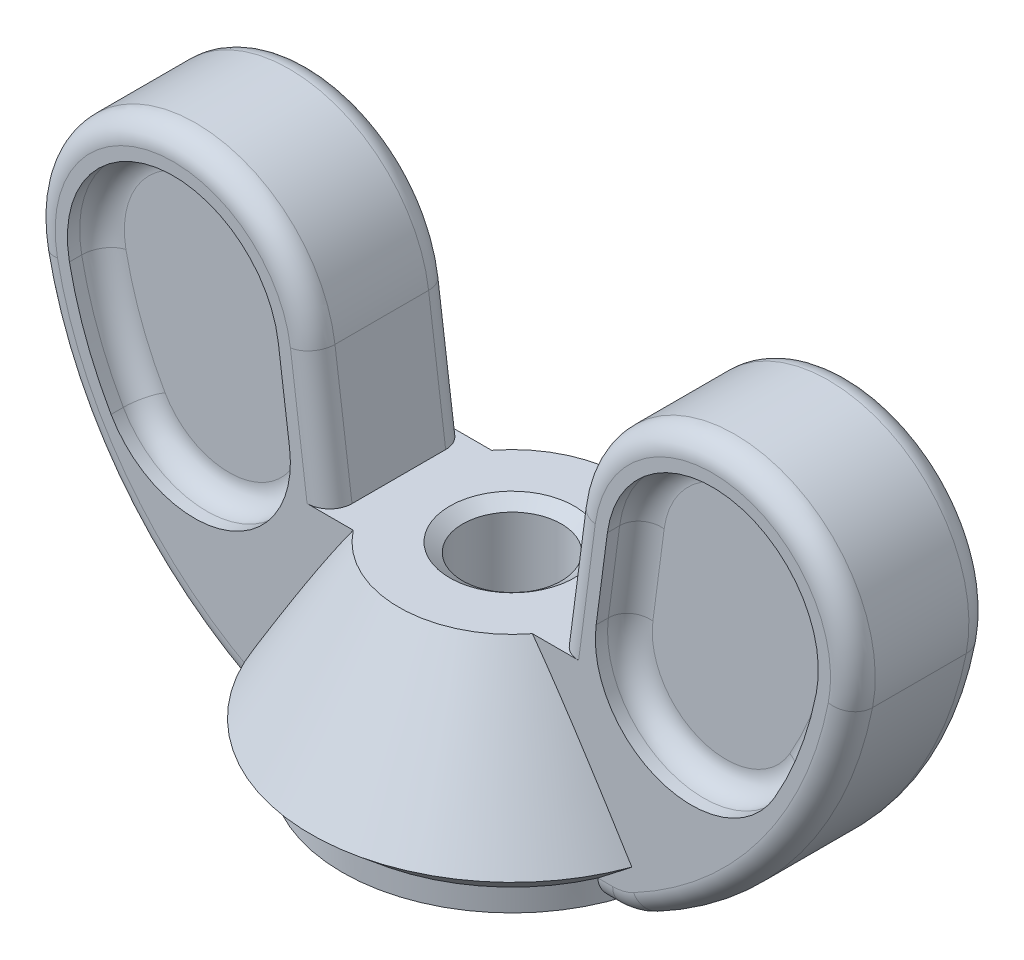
ISO-10303-21;
HEADER;
FILE_DESCRIPTION(('STEP AP214'),'2;1');
FILE_NAME('part.step','',(''),(''),'','','');
FILE_SCHEMA(('AUTOMOTIVE_DESIGN { 1 0 10303 214 1 1 1 1 }'));
ENDSEC;
DATA;
#1=APPLICATION_CONTEXT('core data for automotive mechanical design processes');
#2=APPLICATION_PROTOCOL_DEFINITION('international standard','automotive_design',2000,#1);
#3=PRODUCT_CONTEXT('',#1,'mechanical');
#4=PRODUCT('Part','Part','',(#3));
#5=PRODUCT_RELATED_PRODUCT_CATEGORY('part','',(#4));
#6=PRODUCT_DEFINITION_FORMATION('','',#4);
#7=PRODUCT_DEFINITION_CONTEXT('part definition',#1,'design');
#8=PRODUCT_DEFINITION('design','',#6,#7);
#9=PRODUCT_DEFINITION_SHAPE('','',#8);
#10=(LENGTH_UNIT() NAMED_UNIT(*) SI_UNIT(.MILLI.,.METRE.));
#11=(NAMED_UNIT(*) PLANE_ANGLE_UNIT() SI_UNIT($,.RADIAN.));
#12=(NAMED_UNIT(*) SI_UNIT($,.STERADIAN.) SOLID_ANGLE_UNIT());
#13=UNCERTAINTY_MEASURE_WITH_UNIT(LENGTH_MEASURE(1.E-05),#10,'distance_accuracy_value','');
#14=(GEOMETRIC_REPRESENTATION_CONTEXT(3) GLOBAL_UNCERTAINTY_ASSIGNED_CONTEXT((#13)) GLOBAL_UNIT_ASSIGNED_CONTEXT((#10,
#11,#12)) REPRESENTATION_CONTEXT('',''));
#15=CARTESIAN_POINT('',(0.,0.,0.));
#16=DIRECTION('',(0.,0.,1.));
#17=DIRECTION('',(1.,0.,0.));
#18=AXIS2_PLACEMENT_3D('',#15,#16,#17);
#19=CARTESIAN_POINT('',(3.42900000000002,0.,1.397));
#20=DIRECTION('',(0.,1.,0.));
#21=DIRECTION('',(-1.,0.,0.));
#22=AXIS2_PLACEMENT_3D('',#19,#20,#21);
#23=PLANE('',#22);
#24=CARTESIAN_POINT('',(0.,0.,0.));
#25=DIRECTION('',(0.,-1.,0.));
#26=DIRECTION('',(0.,0.,-1.));
#27=AXIS2_PLACEMENT_3D('',#24,#25,#26);
#28=CIRCLE('',#27,3.42899999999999);
#29=CARTESIAN_POINT('',(-3.29608492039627,0.,-0.945444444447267));
#30=VERTEX_POINT('',#29);
#31=CARTESIAN_POINT('',(3.29608492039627,0.,-0.945444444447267));
#32=VERTEX_POINT('',#31);
#33=EDGE_CURVE('E930',#30,#32,#28,.T.);
#34=ORIENTED_EDGE('',*,*,#33,.T.);
#35=DIRECTION('',(1.,0.,0.));
#36=VECTOR('',#35,1.);
#37=CARTESIAN_POINT('',(3.42900000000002,0.,-0.945444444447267));
#38=LINE('',#37,#36);
#39=CARTESIAN_POINT('',(3.42900000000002,0.,-0.945444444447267));
#40=VERTEX_POINT('',#39);
#41=EDGE_CURVE('E493',#32,#40,#38,.T.);
#42=ORIENTED_EDGE('',*,*,#41,.T.);
#43=DIRECTION('',(0.,0.,-1.));
#44=VECTOR('',#43,1.);
#45=CARTESIAN_POINT('',(3.42900000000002,0.,1.397));
#46=LINE('',#45,#44);
#47=CARTESIAN_POINT('',(3.42900000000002,0.,0.945444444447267));
#48=VERTEX_POINT('',#47);
#49=EDGE_CURVE('E874',#48,#40,#46,.T.);
#50=ORIENTED_EDGE('',*,*,#49,.F.);
#51=DIRECTION('',(1.,0.,0.));
#52=VECTOR('',#51,1.);
#53=CARTESIAN_POINT('',(3.42900000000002,0.,0.945444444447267));
#54=LINE('',#53,#52);
#55=CARTESIAN_POINT('',(3.29608492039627,0.,0.945444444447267));
#56=VERTEX_POINT('',#55);
#57=EDGE_CURVE('E487',#48,#56,#54,.F.);
#58=ORIENTED_EDGE('',*,*,#57,.T.);
#59=CARTESIAN_POINT('',(-3.29608492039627,0.,0.945444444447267));
#60=VERTEX_POINT('',#59);
#61=EDGE_CURVE('E929',#56,#60,#28,.T.);
#62=ORIENTED_EDGE('',*,*,#61,.T.);
#63=DIRECTION('',(1.,0.,0.));
#64=VECTOR('',#63,1.);
#65=CARTESIAN_POINT('',(3.42900000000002,0.,0.945444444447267));
#66=LINE('',#65,#64);
#67=CARTESIAN_POINT('',(-3.429,0.,0.945444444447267));
#68=VERTEX_POINT('',#67);
#69=EDGE_CURVE('E485',#60,#68,#66,.F.);
#70=ORIENTED_EDGE('',*,*,#69,.T.);
#71=DIRECTION('',(0.,0.,-1.));
#72=VECTOR('',#71,1.);
#73=CARTESIAN_POINT('',(-3.429,0.,1.397));
#74=LINE('',#73,#72);
#75=CARTESIAN_POINT('',(-3.429,0.,-0.945444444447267));
#76=VERTEX_POINT('',#75);
#77=EDGE_CURVE('E877',#68,#76,#74,.T.);
#78=ORIENTED_EDGE('',*,*,#77,.T.);
#79=DIRECTION('',(1.,0.,0.));
#80=VECTOR('',#79,1.);
#81=CARTESIAN_POINT('',(-3.13152231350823,0.,-0.945444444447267));
#82=LINE('',#81,#80);
#83=EDGE_CURVE('E490',#76,#30,#82,.T.);
#84=ORIENTED_EDGE('',*,*,#83,.T.);
#85=EDGE_LOOP('',(#34,#42,#50,#58,#62,#70,#78,#84));
#86=FACE_BOUND('',#85,.T.);
#87=CARTESIAN_POINT('',(0.,0.,0.));
#88=DIRECTION('',(0.,1.,0.));
#89=DIRECTION('',(-1.,0.,0.));
#90=AXIS2_PLACEMENT_3D('',#87,#88,#89);
#91=CIRCLE('',#90,1.25729999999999);
#92=CARTESIAN_POINT('',(-1.25729999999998,0.,0.));
#93=VERTEX_POINT('',#92);
#94=EDGE_CURVE('E1062',#93,#93,#91,.T.);
#95=ORIENTED_EDGE('',*,*,#94,.T.);
#96=EDGE_LOOP('',(#95));
#97=FACE_BOUND('',#96,.T.);
#98=ADVANCED_FACE('F49',(#86,#97),#23,.F.);
#99=CARTESIAN_POINT('',(5.4431320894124,6.30659499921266,1.397));
#100=DIRECTION('',(0.,0.,-1.));
#101=DIRECTION('',(-1.,0.,0.));
#102=AXIS2_PLACEMENT_3D('',#99,#100,#101);
#103=PLANE('',#102);
#104=CARTESIAN_POINT('',(5.4431320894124,6.30659499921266,1.397));
#105=DIRECTION('',(0.,0.,-1.));
#106=DIRECTION('',(-1.,0.,0.));
#107=AXIS2_PLACEMENT_3D('',#104,#105,#106);
#108=CIRCLE('',#107,2.13890500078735);
#109=CARTESIAN_POINT('',(7.54101721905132,5.88971062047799,1.397));
#110=VERTEX_POINT('',#109);
#111=CARTESIAN_POINT('',(3.32252571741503,6.58577812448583,1.397));
#112=VERTEX_POINT('',#111);
#113=EDGE_CURVE('E393',#110,#112,#108,.F.);
#114=ORIENTED_EDGE('',*,*,#113,.F.);
#115=CARTESIAN_POINT('',(0.254000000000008,7.33776113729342,1.397));
#116=DIRECTION('',(0.,0.,-1.));
#117=DIRECTION('',(-1.,0.,0.));
#118=AXIS2_PLACEMENT_3D('',#115,#116,#117);
#119=CIRCLE('',#118,7.42949999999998);
#120=CARTESIAN_POINT('',(6.69974767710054,3.64319659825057,1.397));
#121=VERTEX_POINT('',#120);
#122=EDGE_CURVE('E1135',#121,#110,#119,.F.);
#123=ORIENTED_EDGE('',*,*,#122,.F.);
#124=CARTESIAN_POINT('',(5.01763181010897,4.60734939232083,1.397));
#125=DIRECTION('',(0.,0.,-1.));
#126=DIRECTION('',(-1.,0.,0.));
#127=AXIS2_PLACEMENT_3D('',#124,#125,#126);
#128=CIRCLE('',#127,1.93884099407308);
#129=CARTESIAN_POINT('',(3.09537786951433,4.86041892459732,1.397));
#130=VERTEX_POINT('',#129);
#131=EDGE_CURVE('E1137',#130,#121,#128,.F.);
#132=ORIENTED_EDGE('',*,*,#131,.F.);
#133=DIRECTION('',(-0.130526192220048,-0.991444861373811,0.));
#134=VECTOR('',#133,1.);
#135=CARTESIAN_POINT('',(3.32252571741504,6.58577812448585,1.397));
#136=LINE('',#135,#134);
#137=EDGE_CURVE('E1049',#112,#130,#136,.T.);
#138=ORIENTED_EDGE('',*,*,#137,.F.);
#139=EDGE_LOOP('',(#114,#123,#132,#138));
#140=FACE_BOUND('',#139,.T.);
#141=CARTESIAN_POINT('',(-3.81723306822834,0.985083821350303,1.397));
#142=CARTESIAN_POINT('',(-3.69738239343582,0.890669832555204,1.397));
#143=CARTESIAN_POINT('',(-3.57729902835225,0.796546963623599,1.397));
#144=CARTESIAN_POINT('',(-3.33643903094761,0.609148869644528,1.397));
#145=CARTESIAN_POINT('',(-3.21566227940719,0.515873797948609,1.397));
#146=CARTESIAN_POINT('',(-2.97282784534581,0.33016284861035,1.397));
#147=CARTESIAN_POINT('',(-2.85076724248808,0.237730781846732,1.397));
#148=CARTESIAN_POINT('',(-2.60544051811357,0.0544979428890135,1.397));
#149=CARTESIAN_POINT('',(-2.48217451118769,-0.0363029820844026,1.397));
#150=CARTESIAN_POINT('',(-2.26168783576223,-0.195473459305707,1.397));
#151=CARTESIAN_POINT('',(-2.16480991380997,-0.264316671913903,1.397));
#152=CARTESIAN_POINT('',(-1.96965859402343,-0.399996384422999,1.397));
#153=CARTESIAN_POINT('',(-1.87138527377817,-0.466832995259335,1.397));
#154=CARTESIAN_POINT('',(-1.67287677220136,-0.597645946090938,1.397));
#155=CARTESIAN_POINT('',(-1.57264067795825,-0.661620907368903,1.397));
#156=CARTESIAN_POINT('',(-1.36952345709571,-0.785222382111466,1.397));
#157=CARTESIAN_POINT('',(-1.26664337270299,-0.84485057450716,1.397));
#158=CARTESIAN_POINT('',(-1.10452860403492,-0.931820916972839,1.397));
#159=CARTESIAN_POINT('',(-1.046591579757,-0.961571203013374,1.397));
#160=CARTESIAN_POINT('',(-0.929404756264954,-1.01835201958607,1.397));
#161=CARTESIAN_POINT('',(-0.870155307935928,-1.04538326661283,1.397));
#162=CARTESIAN_POINT('',(-0.750252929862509,-1.09585535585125,1.397));
#163=CARTESIAN_POINT('',(-0.6896026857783,-1.11930250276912,1.397));
#164=CARTESIAN_POINT('',(-0.566706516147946,-1.16158875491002,1.397));
#165=CARTESIAN_POINT('',(-0.504461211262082,-1.18042962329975,1.397));
#166=CARTESIAN_POINT('',(-0.392893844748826,-1.20863775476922,1.397));
#167=CARTESIAN_POINT('',(-0.343872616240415,-1.21918622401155,1.397));
#168=CARTESIAN_POINT('',(-0.245141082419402,-1.23627344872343,1.397));
#169=CARTESIAN_POINT('',(-0.19543103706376,-1.24281367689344,1.397));
#170=CARTESIAN_POINT('',(-0.0957584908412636,-1.25147815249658,1.397));
#171=CARTESIAN_POINT('',(-0.0457970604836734,-1.25361449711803,1.397));
#172=CARTESIAN_POINT('',(0.0541167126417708,-1.25336489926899,1.397));
#173=CARTESIAN_POINT('',(0.104069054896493,-1.25097875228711,1.397));
#174=CARTESIAN_POINT('',(0.203362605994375,-1.24186139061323,1.397));
#175=CARTESIAN_POINT('',(0.252705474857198,-1.23514790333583,1.397));
#176=CARTESIAN_POINT('',(0.350697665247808,-1.21779201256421,1.397));
#177=CARTESIAN_POINT('',(0.39934678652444,-1.20714849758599,1.397));
#178=CARTESIAN_POINT('',(0.495963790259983,-1.18241582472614,1.397));
#179=CARTESIAN_POINT('',(0.543928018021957,-1.16831258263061,1.397));
#180=CARTESIAN_POINT('',(0.638895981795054,-1.13724453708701,1.397));
#181=CARTESIAN_POINT('',(0.685899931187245,-1.12028037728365,1.397));
#182=CARTESIAN_POINT('',(0.83631337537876,-1.06168937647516,1.397));
#183=CARTESIAN_POINT('',(0.937906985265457,-1.01541627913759,1.397));
#184=CARTESIAN_POINT('',(1.13747272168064,-0.915560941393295,1.397));
#185=CARTESIAN_POINT('',(1.23543934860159,-0.86196813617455,1.397));
#186=CARTESIAN_POINT('',(1.42905352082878,-0.749850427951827,1.397));
#187=CARTESIAN_POINT('',(1.52468911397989,-0.691305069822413,1.397));
#188=CARTESIAN_POINT('',(1.7138804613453,-0.57109987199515,1.397));
#189=CARTESIAN_POINT('',(1.80743741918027,-0.509441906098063,1.397));
#190=CARTESIAN_POINT('',(1.99395160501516,-0.383345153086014,1.397));
#191=CARTESIAN_POINT('',(2.0868946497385,-0.318885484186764,1.397));
#192=CARTESIAN_POINT('',(2.27165907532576,-0.188359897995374,1.397));
#193=CARTESIAN_POINT('',(2.36348030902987,-0.122293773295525,1.397));
#194=CARTESIAN_POINT('',(2.63724969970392,0.0773426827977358,1.397));
#195=CARTESIAN_POINT('',(2.81793192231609,0.212647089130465,1.397));
#196=CARTESIAN_POINT('',(3.06673422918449,0.401893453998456,1.397));
#197=CARTESIAN_POINT('',(3.13573450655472,0.454692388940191,1.397));
#198=CARTESIAN_POINT('',(3.27350112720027,0.560658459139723,1.397));
#199=CARTESIAN_POINT('',(3.34226735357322,0.613825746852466,1.397));
#200=CARTESIAN_POINT('',(3.47885411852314,0.719885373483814,1.397));
#201=CARTESIAN_POINT('',(3.54667699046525,0.772774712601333,1.397));
#202=CARTESIAN_POINT('',(3.68210398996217,0.8787705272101,1.397));
#203=CARTESIAN_POINT('',(3.74970820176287,0.931876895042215,1.397));
#204=CARTESIAN_POINT('',(3.81723306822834,0.985083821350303,1.397));
#205=B_SPLINE_CURVE_WITH_KNOTS('',3,(#141,#142,#143,#144,#145,#146,#147,#148,#149,#150,#151,
#152,#153,#154,#155,#156,#157,#158,#159,#160,#161,#162,#163,#164,#165,#166,#167,#168,#169,#170,
#171,#172,#173,#174,#175,#176,#177,#178,#179,#180,#181,#182,#183,#184,#185,#186,#187,#188,#189,
#190,#191,#192,#193,#194,#195,#196,#197,#198,#199,#200,#201,#202,#203,#204),.UNSPECIFIED.,.F.,
.F.,(4,2,2,2,2,2,2,2,2,2,2,2,2,2,2,2,2,2,2,2,2,2,2,2,2,2,2,2,2,2,2,4),(0.,0.457719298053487,
0.915519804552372,1.37483915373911,1.8341152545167,2.19064104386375,2.54714708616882,
2.90382307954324,3.26036056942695,3.45569568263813,3.65097918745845,3.8459151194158,
4.04077631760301,4.19106374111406,4.34129591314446,4.49111485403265,4.64094057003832,
4.79015637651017,4.93941441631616,5.0892904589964,5.23913282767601,5.57348963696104,
5.90833423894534,6.24463651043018,6.58073868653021,6.92003981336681,7.2593849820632,
7.93651379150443,8.19716524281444,8.45793192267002,8.71595279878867,8.97385830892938),.UNSPECIFIED.);
#206=CARTESIAN_POINT('',(3.13152231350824,0.451555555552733,1.397));
#207=VERTEX_POINT('',#206);
#208=CARTESIAN_POINT('',(3.81634471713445,0.984383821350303,1.397));
#209=VERTEX_POINT('',#208);
#210=EDGE_CURVE('E932',#207,#209,#205,.T.);
#211=ORIENTED_EDGE('',*,*,#210,.F.);
#212=DIRECTION('',(1.,0.,0.));
#213=VECTOR('',#212,1.);
#214=CARTESIAN_POINT('',(5.4431320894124,0.451555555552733,1.397));
#215=LINE('',#214,#213);
#216=CARTESIAN_POINT('',(3.42900000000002,0.451555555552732,1.397));
#217=VERTEX_POINT('',#216);
#218=EDGE_CURVE('E550',#207,#217,#215,.T.);
#219=ORIENTED_EDGE('',*,*,#218,.T.);
#220=CARTESIAN_POINT('',(3.42900000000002,1.35466666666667,1.397));
#221=DIRECTION('',(0.,0.,-1.));
#222=DIRECTION('',(-1.,0.,0.));
#223=AXIS2_PLACEMENT_3D('',#220,#221,#222);
#224=CIRCLE('',#223,0.903111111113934);
#225=CARTESIAN_POINT('',(3.85233333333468,0.556920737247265,1.397));
#226=VERTEX_POINT('',#225);
#227=EDGE_CURVE('E548',#217,#226,#224,.F.);
#228=ORIENTED_EDGE('',*,*,#227,.T.);
#229=CARTESIAN_POINT('',(0.254000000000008,7.33776113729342,1.397));
#230=DIRECTION('',(0.,0.,-1.));
#231=DIRECTION('',(-1.,0.,0.));
#232=AXIS2_PLACEMENT_3D('',#229,#230,#231);
#233=CIRCLE('',#232,7.67644444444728);
#234=CARTESIAN_POINT('',(7.78322576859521,5.84157978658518,1.397));
#235=VERTEX_POINT('',#234);
#236=EDGE_CURVE('E546',#226,#235,#233,.F.);
#237=ORIENTED_EDGE('',*,*,#236,.T.);
#238=CARTESIAN_POINT('',(5.4431320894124,6.30659499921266,1.397));
#239=DIRECTION('',(0.,0.,-1.));
#240=DIRECTION('',(-1.,0.,0.));
#241=AXIS2_PLACEMENT_3D('',#238,#239,#240);
#242=CIRCLE('',#241,2.38584944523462);
#243=CARTESIAN_POINT('',(3.077693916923,6.61801084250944,1.397));
#244=VERTEX_POINT('',#243);
#245=EDGE_CURVE('E544',#235,#244,#242,.F.);
#246=ORIENTED_EDGE('',*,*,#245,.T.);
#247=DIRECTION('',(-0.130526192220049,-0.991444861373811,0.));
#248=VECTOR('',#247,1.);
#249=CARTESIAN_POINT('',(3.077693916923,6.61801084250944,1.397));
#250=LINE('',#249,#248);
#251=CARTESIAN_POINT('',(2.74145201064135,4.064,1.397));
#252=VERTEX_POINT('',#251);
#253=EDGE_CURVE('E541',#244,#252,#250,.T.);
#254=ORIENTED_EDGE('',*,*,#253,.T.);
#255=DIRECTION('',(-1.,0.,0.));
#256=VECTOR('',#255,1.);
#257=CARTESIAN_POINT('',(-2.28599999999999,4.064,1.397));
#258=LINE('',#257,#256);
#259=CARTESIAN_POINT('',(1.80947146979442,4.064,1.397));
#260=VERTEX_POINT('',#259);
#261=EDGE_CURVE('E857',#252,#260,#258,.T.);
#262=ORIENTED_EDGE('',*,*,#261,.T.);
#263=CARTESIAN_POINT('',(3.81677508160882,0.983683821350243,1.397));
#264=CARTESIAN_POINT('',(3.72797162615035,1.12810935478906,1.397));
#265=CARTESIAN_POINT('',(3.63891634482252,1.27238105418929,1.397));
#266=CARTESIAN_POINT('',(3.46013790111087,1.56053323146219,1.397));
#267=CARTESIAN_POINT('',(3.37041466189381,1.70441366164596,1.397));
#268=CARTESIAN_POINT('',(3.18967907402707,1.99242716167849,1.397));
#269=CARTESIAN_POINT('',(3.09866241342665,2.13655752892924,1.397));
#270=CARTESIAN_POINT('',(2.9155884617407,2.42413730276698,1.397));
#271=CARTESIAN_POINT('',(2.82353127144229,2.56758677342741,1.397));
#272=CARTESIAN_POINT('',(2.61817496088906,2.88425146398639,1.397));
#273=CARTESIAN_POINT('',(2.50455178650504,3.05725692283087,1.397));
#274=CARTESIAN_POINT('',(2.27439792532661,3.40142096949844,1.397));
#275=CARTESIAN_POINT('',(2.15786628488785,3.5725789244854,1.397));
#276=CARTESIAN_POINT('',(1.97997438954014,3.82675062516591,1.397));
#277=CARTESIAN_POINT('',(1.92025929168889,3.91091445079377,1.397));
#278=CARTESIAN_POINT('',(1.79944217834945,4.07823884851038,1.397));
#279=CARTESIAN_POINT('',(1.73834022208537,4.16139946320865,1.397));
#280=CARTESIAN_POINT('',(1.61438364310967,4.32633533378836,1.397));
#281=CARTESIAN_POINT('',(1.55153001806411,4.40811133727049,1.397));
#282=CARTESIAN_POINT('',(1.42347472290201,4.56979735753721,1.397));
#283=CARTESIAN_POINT('',(1.35827348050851,4.64970770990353,1.397));
#284=CARTESIAN_POINT('',(1.26014737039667,4.76507530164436,1.397));
#285=CARTESIAN_POINT('',(1.22847585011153,4.80159691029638,1.397));
#286=CARTESIAN_POINT('',(1.16429883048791,4.87390085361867,1.397));
#287=CARTESIAN_POINT('',(1.13179328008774,4.90968314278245,1.397));
#288=CARTESIAN_POINT('',(1.03265254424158,5.01585834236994,1.397));
#289=CARTESIAN_POINT('',(0.964538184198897,5.08490624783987,1.397));
#290=CARTESIAN_POINT('',(0.824756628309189,5.21539718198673,1.397));
#291=CARTESIAN_POINT('',(0.753235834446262,5.27699564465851,1.397));
#292=CARTESIAN_POINT('',(0.603015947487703,5.39060055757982,1.397));
#293=CARTESIAN_POINT('',(0.524354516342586,5.44265340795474,1.397));
#294=CARTESIAN_POINT('',(0.416457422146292,5.49890165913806,1.397));
#295=CARTESIAN_POINT('',(0.391365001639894,5.51100990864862,1.397));
#296=CARTESIAN_POINT('',(0.340373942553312,5.5333919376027,1.397));
#297=CARTESIAN_POINT('',(0.314475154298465,5.54366537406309,1.397));
#298=CARTESIAN_POINT('',(0.235782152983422,5.57118545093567,1.397));
#299=CARTESIAN_POINT('',(0.181786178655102,5.58524393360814,1.397));
#300=CARTESIAN_POINT('',(0.0806560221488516,5.60109284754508,1.397));
#301=CARTESIAN_POINT('',(0.0337713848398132,5.60445963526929,1.397));
#302=CARTESIAN_POINT('',(-0.0599237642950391,5.60294455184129,1.397));
#303=CARTESIAN_POINT('',(-0.10673410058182,5.59805195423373,1.397));
#304=CARTESIAN_POINT('',(-0.209261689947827,5.5787448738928,1.397));
#305=CARTESIAN_POINT('',(-0.264613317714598,5.56243570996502,1.397));
#306=CARTESIAN_POINT('',(-0.371948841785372,5.52116928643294,1.397));
#307=CARTESIAN_POINT('',(-0.423925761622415,5.49619474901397,1.397));
#308=CARTESIAN_POINT('',(-0.531545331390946,5.43628491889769,1.397));
#309=CARTESIAN_POINT('',(-0.586669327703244,5.40044110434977,1.397));
#310=CARTESIAN_POINT('',(-0.693230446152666,5.3235758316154,1.397));
#311=CARTESIAN_POINT('',(-0.744660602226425,5.28254497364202,1.397));
#312=CARTESIAN_POINT('',(-0.84487312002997,5.19672515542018,1.397));
#313=CARTESIAN_POINT('',(-0.893634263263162,5.15191174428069,1.397));
#314=CARTESIAN_POINT('',(-0.988723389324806,5.05988244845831,1.397));
#315=CARTESIAN_POINT('',(-1.03505351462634,5.01266875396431,1.397));
#316=CARTESIAN_POINT('',(-1.1295062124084,4.91258266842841,1.397));
#317=CARTESIAN_POINT('',(-1.17747027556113,4.85956159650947,1.397));
#318=CARTESIAN_POINT('',(-1.27167207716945,4.75200230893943,1.397));
#319=CARTESIAN_POINT('',(-1.3179095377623,4.69746385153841,1.397));
#320=CARTESIAN_POINT('',(-1.45462440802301,4.53209044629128,1.397));
#321=CARTESIAN_POINT('',(-1.54304673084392,4.41956047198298,1.397));
#322=CARTESIAN_POINT('',(-1.71645386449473,4.19149852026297,1.397));
#323=CARTESIAN_POINT('',(-1.80142999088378,4.07596003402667,1.397));
#324=CARTESIAN_POINT('',(-1.96877704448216,3.84307836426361,1.397));
#325=CARTESIAN_POINT('',(-2.05114887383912,3.72573582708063,1.397));
#326=CARTESIAN_POINT('',(-2.21397011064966,3.4898254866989,1.397));
#327=CARTESIAN_POINT('',(-2.29442055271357,3.37125839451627,1.397));
#328=CARTESIAN_POINT('',(-2.45390970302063,3.13316623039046,1.397));
#329=CARTESIAN_POINT('',(-2.53294829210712,3.01364107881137,1.397));
#330=CARTESIAN_POINT('',(-2.76824892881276,2.65429522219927,1.397));
#331=CARTESIAN_POINT('',(-2.92289246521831,2.41341534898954,1.397));
#332=CARTESIAN_POINT('',(-3.13870872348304,2.07303967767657,1.397));
#333=CARTESIAN_POINT('',(-3.2010214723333,1.97426054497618,1.397));
#334=CARTESIAN_POINT('',(-3.32526716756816,1.77642910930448,1.397));
#335=CARTESIAN_POINT('',(-3.38720001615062,1.67737674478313,1.397));
#336=CARTESIAN_POINT('',(-3.51057898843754,1.47930681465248,1.397));
#337=CARTESIAN_POINT('',(-3.5720259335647,1.38028976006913,1.397));
#338=CARTESIAN_POINT('',(-3.69461453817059,1.18210153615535,1.397));
#339=CARTESIAN_POINT('',(-3.75575627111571,1.08293041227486,1.397));
#340=CARTESIAN_POINT('',(-3.81677508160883,0.983683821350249,1.397));
#341=B_SPLINE_CURVE_WITH_KNOTS('',3,(#263,#264,#265,#266,#267,#268,#269,#270,#271,#272,#273,
#274,#275,#276,#277,#278,#279,#280,#281,#282,#283,#284,#285,#286,#287,#288,#289,#290,#291,#292,
#293,#294,#295,#296,#297,#298,#299,#300,#301,#302,#303,#304,#305,#306,#307,#308,#309,#310,#311,
#312,#313,#314,#315,#316,#317,#318,#319,#320,#321,#322,#323,#324,#325,#326,#327,#328,#329,#330,
#331,#332,#333,#334,#335,#336,#337,#338,#339,#340),.UNSPECIFIED.,.F.,.F.,(4,2,2,2,2,2,2,2,2,2,2,
2,2,2,2,2,2,2,2,2,2,2,2,2,2,2,2,2,2,2,2,2,2,2,2,2,2,2,4),(0.,0.508629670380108,1.01731877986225,
1.5287039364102,2.04003997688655,2.66096689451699,3.28210015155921,3.59167835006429,
3.90124335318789,4.21063550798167,4.51997157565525,4.6649841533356,4.81000563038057,
5.1007257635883,5.38356351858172,5.66498771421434,5.74850460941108,5.83203710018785,
5.99840800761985,6.13872642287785,6.27922720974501,6.45133961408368,6.62379718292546,
6.82060525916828,7.01777523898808,7.21633499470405,7.41471671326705,7.62915781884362,
7.84363328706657,8.27283993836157,8.70306835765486,9.13314607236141,9.56298672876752,
9.99286349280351,10.8515691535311,11.2019430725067,11.5524036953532,11.9020043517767,
12.2515163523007),.UNSPECIFIED.);
#342=EDGE_CURVE('E928',#209,#260,#341,.T.);
#343=ORIENTED_EDGE('',*,*,#342,.F.);
#344=EDGE_LOOP('',(#211,#219,#228,#237,#246,#254,#262,#343));
#345=FACE_BOUND('',#344,.T.);
#346=ADVANCED_FACE('F690',(#140,#345),#103,.F.);
#347=CARTESIAN_POINT('',(-0.253999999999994,7.33776113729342,1.397));
#348=DIRECTION('',(0.,0.,-1.));
#349=DIRECTION('',(-1.,0.,0.));
#350=AXIS2_PLACEMENT_3D('',#347,#348,#349);
#351=CIRCLE('',#350,7.4295);
#352=CARTESIAN_POINT('',(-7.54101721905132,5.88971062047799,1.397));
#353=VERTEX_POINT('',#352);
#354=CARTESIAN_POINT('',(-6.69974767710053,3.64319659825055,1.397));
#355=VERTEX_POINT('',#354);
#356=EDGE_CURVE('E1130',#353,#355,#351,.F.);
#357=ORIENTED_EDGE('',*,*,#356,.F.);
#358=CARTESIAN_POINT('',(-5.4431320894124,6.30659499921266,1.397));
#359=DIRECTION('',(0.,0.,-1.));
#360=DIRECTION('',(-1.,0.,0.));
#361=AXIS2_PLACEMENT_3D('',#358,#359,#360);
#362=CIRCLE('',#361,2.13890500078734);
#363=CARTESIAN_POINT('',(-3.32252571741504,6.58577812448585,1.397));
#364=VERTEX_POINT('',#363);
#365=EDGE_CURVE('E1109',#364,#353,#362,.F.);
#366=ORIENTED_EDGE('',*,*,#365,.F.);
#367=DIRECTION('',(-0.130526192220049,0.991444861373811,0.));
#368=VECTOR('',#367,1.);
#369=CARTESIAN_POINT('',(-3.13705548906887,5.17699187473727,1.397));
#370=LINE('',#369,#368);
#371=CARTESIAN_POINT('',(-3.09537786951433,4.8604189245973,1.397));
#372=VERTEX_POINT('',#371);
#373=EDGE_CURVE('E1105',#372,#364,#370,.T.);
#374=ORIENTED_EDGE('',*,*,#373,.F.);
#375=CARTESIAN_POINT('',(-5.01763181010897,4.60734939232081,1.397));
#376=DIRECTION('',(0.,0.,-1.));
#377=DIRECTION('',(-1.,0.,0.));
#378=AXIS2_PLACEMENT_3D('',#375,#376,#377);
#379=CIRCLE('',#378,1.93884099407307);
#380=EDGE_CURVE('E1126',#355,#372,#379,.F.);
#381=ORIENTED_EDGE('',*,*,#380,.F.);
#382=EDGE_LOOP('',(#357,#366,#374,#381));
#383=FACE_BOUND('',#382,.T.);
#384=CARTESIAN_POINT('',(-3.429,1.35466666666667,1.397));
#385=DIRECTION('',(0.,0.,-1.));
#386=DIRECTION('',(-1.,0.,0.));
#387=AXIS2_PLACEMENT_3D('',#384,#385,#386);
#388=CIRCLE('',#387,0.903111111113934);
#389=CARTESIAN_POINT('',(-3.85233333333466,0.556920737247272,1.397));
#390=VERTEX_POINT('',#389);
#391=CARTESIAN_POINT('',(-3.429,0.451555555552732,1.397));
#392=VERTEX_POINT('',#391);
#393=EDGE_CURVE('E559',#390,#392,#388,.F.);
#394=ORIENTED_EDGE('',*,*,#393,.T.);
#395=DIRECTION('',(1.,0.,0.));
#396=VECTOR('',#395,1.);
#397=CARTESIAN_POINT('',(5.4431320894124,0.451555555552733,1.397));
#398=LINE('',#397,#396);
#399=CARTESIAN_POINT('',(-3.13152231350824,0.451555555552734,1.397));
#400=VERTEX_POINT('',#399);
#401=EDGE_CURVE('E561',#392,#400,#398,.T.);
#402=ORIENTED_EDGE('',*,*,#401,.T.);
#403=CARTESIAN_POINT('',(-3.81634471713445,0.984383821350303,1.397));
#404=VERTEX_POINT('',#403);
#405=EDGE_CURVE('E940',#404,#400,#205,.T.);
#406=ORIENTED_EDGE('',*,*,#405,.F.);
#407=CARTESIAN_POINT('',(-1.80947146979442,4.064,1.397));
#408=VERTEX_POINT('',#407);
#409=EDGE_CURVE('E920',#408,#404,#341,.T.);
#410=ORIENTED_EDGE('',*,*,#409,.F.);
#411=CARTESIAN_POINT('',(-2.74145201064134,4.064,1.397));
#412=VERTEX_POINT('',#411);
#413=EDGE_CURVE('E852',#408,#412,#258,.T.);
#414=ORIENTED_EDGE('',*,*,#413,.T.);
#415=DIRECTION('',(-0.130526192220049,0.991444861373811,0.));
#416=VECTOR('',#415,1.);
#417=CARTESIAN_POINT('',(-2.89222368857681,5.20922459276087,1.397));
#418=LINE('',#417,#416);
#419=CARTESIAN_POINT('',(-3.07769391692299,6.61801084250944,1.397));
#420=VERTEX_POINT('',#419);
#421=EDGE_CURVE('E553',#412,#420,#418,.T.);
#422=ORIENTED_EDGE('',*,*,#421,.T.);
#423=CARTESIAN_POINT('',(-5.4431320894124,6.30659499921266,1.397));
#424=DIRECTION('',(0.,0.,-1.));
#425=DIRECTION('',(-1.,0.,0.));
#426=AXIS2_PLACEMENT_3D('',#423,#424,#425);
#427=CIRCLE('',#426,2.38584944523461);
#428=CARTESIAN_POINT('',(-7.78322576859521,5.84157978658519,1.397));
#429=VERTEX_POINT('',#428);
#430=EDGE_CURVE('E555',#420,#429,#427,.F.);
#431=ORIENTED_EDGE('',*,*,#430,.T.);
#432=CARTESIAN_POINT('',(-0.253999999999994,7.33776113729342,1.397));
#433=DIRECTION('',(0.,0.,-1.));
#434=DIRECTION('',(-1.,0.,0.));
#435=AXIS2_PLACEMENT_3D('',#432,#433,#434);
#436=CIRCLE('',#435,7.67644444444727);
#437=EDGE_CURVE('E557',#429,#390,#436,.F.);
#438=ORIENTED_EDGE('',*,*,#437,.T.);
#439=EDGE_LOOP('',(#394,#402,#406,#410,#414,#422,#431,#438));
#440=FACE_BOUND('',#439,.T.);
#441=ADVANCED_FACE('F697',(#383,#440),#103,.F.);
#442=CARTESIAN_POINT('',(5.4431320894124,6.30659499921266,-1.397));
#443=DIRECTION('',(0.,0.,-1.));
#444=DIRECTION('',(-1.,0.,0.));
#445=AXIS2_PLACEMENT_3D('',#442,#443,#444);
#446=PLANE('',#445);
#447=CARTESIAN_POINT('',(5.4431320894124,6.30659499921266,-1.397));
#448=DIRECTION('',(0.,0.,-1.));
#449=DIRECTION('',(-1.,0.,0.));
#450=AXIS2_PLACEMENT_3D('',#447,#448,#449);
#451=CIRCLE('',#450,2.13890500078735);
#452=CARTESIAN_POINT('',(3.32252571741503,6.58577812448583,-1.397));
#453=VERTEX_POINT('',#452);
#454=CARTESIAN_POINT('',(7.54101721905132,5.88971062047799,-1.397));
#455=VERTEX_POINT('',#454);
#456=EDGE_CURVE('E419',#453,#455,#451,.T.);
#457=ORIENTED_EDGE('',*,*,#456,.F.);
#458=DIRECTION('',(0.130526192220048,0.991444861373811,0.));
#459=VECTOR('',#458,1.);
#460=CARTESIAN_POINT('',(3.32252571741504,6.58577812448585,-1.397));
#461=LINE('',#460,#459);
#462=CARTESIAN_POINT('',(3.09537786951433,4.86041892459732,-1.397));
#463=VERTEX_POINT('',#462);
#464=EDGE_CURVE('E408',#463,#453,#461,.T.);
#465=ORIENTED_EDGE('',*,*,#464,.F.);
#466=CARTESIAN_POINT('',(5.01763181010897,4.60734939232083,-1.397));
#467=DIRECTION('',(0.,0.,-1.));
#468=DIRECTION('',(-1.,0.,0.));
#469=AXIS2_PLACEMENT_3D('',#466,#467,#468);
#470=CIRCLE('',#469,1.93884099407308);
#471=CARTESIAN_POINT('',(6.69974767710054,3.64319659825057,-1.397));
#472=VERTEX_POINT('',#471);
#473=EDGE_CURVE('E410',#472,#463,#470,.T.);
#474=ORIENTED_EDGE('',*,*,#473,.F.);
#475=CARTESIAN_POINT('',(0.254000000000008,7.33776113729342,-1.397));
#476=DIRECTION('',(0.,0.,-1.));
#477=DIRECTION('',(-1.,0.,0.));
#478=AXIS2_PLACEMENT_3D('',#475,#476,#477);
#479=CIRCLE('',#478,7.42949999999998);
#480=EDGE_CURVE('E417',#455,#472,#479,.T.);
#481=ORIENTED_EDGE('',*,*,#480,.F.);
#482=EDGE_LOOP('',(#457,#465,#474,#481));
#483=FACE_BOUND('',#482,.T.);
#484=CARTESIAN_POINT('',(3.42900000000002,1.35466666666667,-1.397));
#485=DIRECTION('',(0.,0.,-1.));
#486=DIRECTION('',(-1.,0.,0.));
#487=AXIS2_PLACEMENT_3D('',#484,#485,#486);
#488=CIRCLE('',#487,0.903111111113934);
#489=CARTESIAN_POINT('',(3.85233333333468,0.556920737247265,-1.397));
#490=VERTEX_POINT('',#489);
#491=CARTESIAN_POINT('',(3.42900000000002,0.451555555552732,-1.397));
#492=VERTEX_POINT('',#491);
#493=EDGE_CURVE('E502',#490,#492,#488,.T.);
#494=ORIENTED_EDGE('',*,*,#493,.T.);
#495=DIRECTION('',(1.,0.,0.));
#496=VECTOR('',#495,1.);
#497=CARTESIAN_POINT('',(3.13152231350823,0.451555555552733,-1.397));
#498=LINE('',#497,#496);
#499=CARTESIAN_POINT('',(3.13152231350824,0.451555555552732,-1.397));
#500=VERTEX_POINT('',#499);
#501=EDGE_CURVE('E504',#492,#500,#498,.F.);
#502=ORIENTED_EDGE('',*,*,#501,.T.);
#503=CARTESIAN_POINT('',(-3.81723306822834,0.985083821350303,-1.397));
#504=CARTESIAN_POINT('',(-3.69738239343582,0.890669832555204,-1.397));
#505=CARTESIAN_POINT('',(-3.57729902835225,0.796546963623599,-1.397));
#506=CARTESIAN_POINT('',(-3.33643903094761,0.609148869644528,-1.397));
#507=CARTESIAN_POINT('',(-3.21566227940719,0.515873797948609,-1.397));
#508=CARTESIAN_POINT('',(-2.97282784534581,0.33016284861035,-1.397));
#509=CARTESIAN_POINT('',(-2.85076724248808,0.237730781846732,-1.397));
#510=CARTESIAN_POINT('',(-2.60544051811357,0.0544979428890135,-1.397));
#511=CARTESIAN_POINT('',(-2.48217451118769,-0.0363029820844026,-1.397));
#512=CARTESIAN_POINT('',(-2.26168783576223,-0.195473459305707,-1.397));
#513=CARTESIAN_POINT('',(-2.16480991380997,-0.264316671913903,-1.397));
#514=CARTESIAN_POINT('',(-1.96965859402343,-0.399996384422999,-1.397));
#515=CARTESIAN_POINT('',(-1.87138527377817,-0.466832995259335,-1.397));
#516=CARTESIAN_POINT('',(-1.67287677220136,-0.597645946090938,-1.397));
#517=CARTESIAN_POINT('',(-1.57264067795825,-0.661620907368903,-1.397));
#518=CARTESIAN_POINT('',(-1.36952345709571,-0.785222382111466,-1.397));
#519=CARTESIAN_POINT('',(-1.26664337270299,-0.84485057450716,-1.397));
#520=CARTESIAN_POINT('',(-1.10452860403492,-0.931820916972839,-1.397));
#521=CARTESIAN_POINT('',(-1.046591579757,-0.961571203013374,-1.397));
#522=CARTESIAN_POINT('',(-0.929404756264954,-1.01835201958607,-1.397));
#523=CARTESIAN_POINT('',(-0.870155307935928,-1.04538326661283,-1.397));
#524=CARTESIAN_POINT('',(-0.750252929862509,-1.09585535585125,-1.397));
#525=CARTESIAN_POINT('',(-0.6896026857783,-1.11930250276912,-1.397));
#526=CARTESIAN_POINT('',(-0.566706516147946,-1.16158875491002,-1.397));
#527=CARTESIAN_POINT('',(-0.504461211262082,-1.18042962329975,-1.397));
#528=CARTESIAN_POINT('',(-0.392893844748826,-1.20863775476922,-1.397));
#529=CARTESIAN_POINT('',(-0.343872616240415,-1.21918622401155,-1.397));
#530=CARTESIAN_POINT('',(-0.245141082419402,-1.23627344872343,-1.397));
#531=CARTESIAN_POINT('',(-0.19543103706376,-1.24281367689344,-1.397));
#532=CARTESIAN_POINT('',(-0.0957584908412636,-1.25147815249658,-1.397));
#533=CARTESIAN_POINT('',(-0.0457970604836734,-1.25361449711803,-1.397));
#534=CARTESIAN_POINT('',(0.0541167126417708,-1.25336489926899,-1.397));
#535=CARTESIAN_POINT('',(0.104069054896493,-1.25097875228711,-1.397));
#536=CARTESIAN_POINT('',(0.203362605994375,-1.24186139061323,-1.397));
#537=CARTESIAN_POINT('',(0.252705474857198,-1.23514790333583,-1.397));
#538=CARTESIAN_POINT('',(0.350697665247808,-1.21779201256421,-1.397));
#539=CARTESIAN_POINT('',(0.39934678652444,-1.20714849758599,-1.397));
#540=CARTESIAN_POINT('',(0.495963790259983,-1.18241582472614,-1.397));
#541=CARTESIAN_POINT('',(0.543928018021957,-1.16831258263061,-1.397));
#542=CARTESIAN_POINT('',(0.638895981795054,-1.13724453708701,-1.397));
#543=CARTESIAN_POINT('',(0.685899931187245,-1.12028037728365,-1.397));
#544=CARTESIAN_POINT('',(0.83631337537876,-1.06168937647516,-1.397));
#545=CARTESIAN_POINT('',(0.937906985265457,-1.01541627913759,-1.397));
#546=CARTESIAN_POINT('',(1.13747272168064,-0.915560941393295,-1.397));
#547=CARTESIAN_POINT('',(1.23543934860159,-0.86196813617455,-1.397));
#548=CARTESIAN_POINT('',(1.42905352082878,-0.749850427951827,-1.397));
#549=CARTESIAN_POINT('',(1.52468911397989,-0.691305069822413,-1.397));
#550=CARTESIAN_POINT('',(1.7138804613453,-0.57109987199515,-1.397));
#551=CARTESIAN_POINT('',(1.80743741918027,-0.509441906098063,-1.397));
#552=CARTESIAN_POINT('',(1.99395160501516,-0.383345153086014,-1.397));
#553=CARTESIAN_POINT('',(2.0868946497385,-0.318885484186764,-1.397));
#554=CARTESIAN_POINT('',(2.27165907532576,-0.188359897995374,-1.397));
#555=CARTESIAN_POINT('',(2.36348030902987,-0.122293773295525,-1.397));
#556=CARTESIAN_POINT('',(2.63724969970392,0.0773426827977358,-1.397));
#557=CARTESIAN_POINT('',(2.81793192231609,0.212647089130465,-1.397));
#558=CARTESIAN_POINT('',(3.06673422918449,0.401893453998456,-1.397));
#559=CARTESIAN_POINT('',(3.13573450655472,0.454692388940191,-1.397));
#560=CARTESIAN_POINT('',(3.27350112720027,0.560658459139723,-1.397));
#561=CARTESIAN_POINT('',(3.34226735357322,0.613825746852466,-1.397));
#562=CARTESIAN_POINT('',(3.47885411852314,0.719885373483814,-1.397));
#563=CARTESIAN_POINT('',(3.54667699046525,0.772774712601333,-1.397));
#564=CARTESIAN_POINT('',(3.68210398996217,0.8787705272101,-1.397));
#565=CARTESIAN_POINT('',(3.74970820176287,0.931876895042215,-1.397));
#566=CARTESIAN_POINT('',(3.81723306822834,0.985083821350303,-1.397));
#567=B_SPLINE_CURVE_WITH_KNOTS('',3,(#503,#504,#505,#506,#507,#508,#509,#510,#511,#512,#513,
#514,#515,#516,#517,#518,#519,#520,#521,#522,#523,#524,#525,#526,#527,#528,#529,#530,#531,#532,
#533,#534,#535,#536,#537,#538,#539,#540,#541,#542,#543,#544,#545,#546,#547,#548,#549,#550,#551,
#552,#553,#554,#555,#556,#557,#558,#559,#560,#561,#562,#563,#564,#565,#566),.UNSPECIFIED.,.F.,
.F.,(4,2,2,2,2,2,2,2,2,2,2,2,2,2,2,2,2,2,2,2,2,2,2,2,2,2,2,2,2,2,2,4),(0.,0.457719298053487,
0.915519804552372,1.37483915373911,1.8341152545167,2.19064104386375,2.54714708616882,
2.90382307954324,3.26036056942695,3.45569568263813,3.65097918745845,3.8459151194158,
4.04077631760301,4.19106374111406,4.34129591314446,4.49111485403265,4.64094057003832,
4.79015637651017,4.93941441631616,5.0892904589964,5.23913282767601,5.57348963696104,
5.90833423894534,6.24463651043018,6.58073868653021,6.92003981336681,7.2593849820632,
7.93651379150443,8.19716524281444,8.45793192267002,8.71595279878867,8.97385830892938),.UNSPECIFIED.);
#568=CARTESIAN_POINT('',(3.81634471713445,0.984383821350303,-1.397));
#569=VERTEX_POINT('',#568);
#570=EDGE_CURVE('E1132',#500,#569,#567,.T.);
#571=ORIENTED_EDGE('',*,*,#570,.T.);
#572=CARTESIAN_POINT('',(3.81677508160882,0.983683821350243,-1.397));
#573=CARTESIAN_POINT('',(3.72797162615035,1.12810935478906,-1.397));
#574=CARTESIAN_POINT('',(3.63891634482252,1.27238105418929,-1.397));
#575=CARTESIAN_POINT('',(3.46013790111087,1.56053323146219,-1.397));
#576=CARTESIAN_POINT('',(3.37041466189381,1.70441366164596,-1.397));
#577=CARTESIAN_POINT('',(3.18967907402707,1.99242716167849,-1.397));
#578=CARTESIAN_POINT('',(3.09866241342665,2.13655752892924,-1.397));
#579=CARTESIAN_POINT('',(2.9155884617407,2.42413730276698,-1.397));
#580=CARTESIAN_POINT('',(2.82353127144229,2.56758677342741,-1.397));
#581=CARTESIAN_POINT('',(2.61817496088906,2.88425146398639,-1.397));
#582=CARTESIAN_POINT('',(2.50455178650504,3.05725692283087,-1.397));
#583=CARTESIAN_POINT('',(2.27439792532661,3.40142096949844,-1.397));
#584=CARTESIAN_POINT('',(2.15786628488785,3.5725789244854,-1.397));
#585=CARTESIAN_POINT('',(1.97997438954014,3.82675062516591,-1.397));
#586=CARTESIAN_POINT('',(1.92025929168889,3.91091445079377,-1.397));
#587=CARTESIAN_POINT('',(1.79944217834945,4.07823884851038,-1.397));
#588=CARTESIAN_POINT('',(1.73834022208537,4.16139946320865,-1.397));
#589=CARTESIAN_POINT('',(1.61438364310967,4.32633533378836,-1.397));
#590=CARTESIAN_POINT('',(1.55153001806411,4.40811133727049,-1.397));
#591=CARTESIAN_POINT('',(1.42347472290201,4.56979735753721,-1.397));
#592=CARTESIAN_POINT('',(1.35827348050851,4.64970770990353,-1.397));
#593=CARTESIAN_POINT('',(1.26014737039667,4.76507530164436,-1.397));
#594=CARTESIAN_POINT('',(1.22847585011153,4.80159691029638,-1.397));
#595=CARTESIAN_POINT('',(1.16429883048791,4.87390085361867,-1.397));
#596=CARTESIAN_POINT('',(1.13179328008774,4.90968314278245,-1.397));
#597=CARTESIAN_POINT('',(1.03265254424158,5.01585834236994,-1.397));
#598=CARTESIAN_POINT('',(0.964538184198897,5.08490624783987,-1.397));
#599=CARTESIAN_POINT('',(0.824756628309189,5.21539718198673,-1.397));
#600=CARTESIAN_POINT('',(0.753235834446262,5.27699564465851,-1.397));
#601=CARTESIAN_POINT('',(0.603015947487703,5.39060055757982,-1.397));
#602=CARTESIAN_POINT('',(0.524354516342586,5.44265340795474,-1.397));
#603=CARTESIAN_POINT('',(0.416457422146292,5.49890165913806,-1.397));
#604=CARTESIAN_POINT('',(0.391365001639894,5.51100990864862,-1.397));
#605=CARTESIAN_POINT('',(0.340373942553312,5.5333919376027,-1.397));
#606=CARTESIAN_POINT('',(0.314475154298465,5.54366537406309,-1.397));
#607=CARTESIAN_POINT('',(0.235782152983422,5.57118545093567,-1.397));
#608=CARTESIAN_POINT('',(0.181786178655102,5.58524393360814,-1.397));
#609=CARTESIAN_POINT('',(0.0806560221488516,5.60109284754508,-1.397));
#610=CARTESIAN_POINT('',(0.0337713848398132,5.60445963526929,-1.397));
#611=CARTESIAN_POINT('',(-0.0599237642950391,5.60294455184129,-1.397));
#612=CARTESIAN_POINT('',(-0.10673410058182,5.59805195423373,-1.397));
#613=CARTESIAN_POINT('',(-0.209261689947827,5.5787448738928,-1.397));
#614=CARTESIAN_POINT('',(-0.264613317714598,5.56243570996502,-1.397));
#615=CARTESIAN_POINT('',(-0.371948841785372,5.52116928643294,-1.397));
#616=CARTESIAN_POINT('',(-0.423925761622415,5.49619474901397,-1.397));
#617=CARTESIAN_POINT('',(-0.531545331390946,5.43628491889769,-1.397));
#618=CARTESIAN_POINT('',(-0.586669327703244,5.40044110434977,-1.397));
#619=CARTESIAN_POINT('',(-0.693230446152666,5.3235758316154,-1.397));
#620=CARTESIAN_POINT('',(-0.744660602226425,5.28254497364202,-1.397));
#621=CARTESIAN_POINT('',(-0.84487312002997,5.19672515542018,-1.397));
#622=CARTESIAN_POINT('',(-0.893634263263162,5.15191174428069,-1.397));
#623=CARTESIAN_POINT('',(-0.988723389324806,5.05988244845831,-1.397));
#624=CARTESIAN_POINT('',(-1.03505351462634,5.01266875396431,-1.397));
#625=CARTESIAN_POINT('',(-1.1295062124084,4.91258266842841,-1.397));
#626=CARTESIAN_POINT('',(-1.17747027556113,4.85956159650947,-1.397));
#627=CARTESIAN_POINT('',(-1.27167207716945,4.75200230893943,-1.397));
#628=CARTESIAN_POINT('',(-1.3179095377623,4.69746385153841,-1.397));
#629=CARTESIAN_POINT('',(-1.45462440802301,4.53209044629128,-1.397));
#630=CARTESIAN_POINT('',(-1.54304673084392,4.41956047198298,-1.397));
#631=CARTESIAN_POINT('',(-1.71645386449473,4.19149852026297,-1.397));
#632=CARTESIAN_POINT('',(-1.80142999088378,4.07596003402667,-1.397));
#633=CARTESIAN_POINT('',(-1.96877704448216,3.84307836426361,-1.397));
#634=CARTESIAN_POINT('',(-2.05114887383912,3.72573582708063,-1.397));
#635=CARTESIAN_POINT('',(-2.21397011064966,3.4898254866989,-1.397));
#636=CARTESIAN_POINT('',(-2.29442055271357,3.37125839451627,-1.397));
#637=CARTESIAN_POINT('',(-2.45390970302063,3.13316623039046,-1.397));
#638=CARTESIAN_POINT('',(-2.53294829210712,3.01364107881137,-1.397));
#639=CARTESIAN_POINT('',(-2.76824892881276,2.65429522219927,-1.397));
#640=CARTESIAN_POINT('',(-2.92289246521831,2.41341534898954,-1.397));
#641=CARTESIAN_POINT('',(-3.13870872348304,2.07303967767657,-1.397));
#642=CARTESIAN_POINT('',(-3.2010214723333,1.97426054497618,-1.397));
#643=CARTESIAN_POINT('',(-3.32526716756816,1.77642910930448,-1.397));
#644=CARTESIAN_POINT('',(-3.38720001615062,1.67737674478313,-1.397));
#645=CARTESIAN_POINT('',(-3.51057898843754,1.47930681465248,-1.397));
#646=CARTESIAN_POINT('',(-3.5720259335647,1.38028976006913,-1.397));
#647=CARTESIAN_POINT('',(-3.69461453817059,1.18210153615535,-1.397));
#648=CARTESIAN_POINT('',(-3.75575627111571,1.08293041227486,-1.397));
#649=CARTESIAN_POINT('',(-3.81677508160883,0.983683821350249,-1.397));
#650=B_SPLINE_CURVE_WITH_KNOTS('',3,(#572,#573,#574,#575,#576,#577,#578,#579,#580,#581,#582,
#583,#584,#585,#586,#587,#588,#589,#590,#591,#592,#593,#594,#595,#596,#597,#598,#599,#600,#601,
#602,#603,#604,#605,#606,#607,#608,#609,#610,#611,#612,#613,#614,#615,#616,#617,#618,#619,#620,
#621,#622,#623,#624,#625,#626,#627,#628,#629,#630,#631,#632,#633,#634,#635,#636,#637,#638,#639,
#640,#641,#642,#643,#644,#645,#646,#647,#648,#649),.UNSPECIFIED.,.F.,.F.,(4,2,2,2,2,2,2,2,2,2,2,
2,2,2,2,2,2,2,2,2,2,2,2,2,2,2,2,2,2,2,2,2,2,2,2,2,2,2,4),(0.,0.508629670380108,1.01731877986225,
1.5287039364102,2.04003997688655,2.66096689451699,3.28210015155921,3.59167835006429,
3.90124335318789,4.21063550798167,4.51997157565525,4.6649841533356,4.81000563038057,
5.1007257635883,5.38356351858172,5.66498771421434,5.74850460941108,5.83203710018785,
5.99840800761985,6.13872642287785,6.27922720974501,6.45133961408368,6.62379718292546,
6.82060525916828,7.01777523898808,7.21633499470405,7.41471671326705,7.62915781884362,
7.84363328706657,8.27283993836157,8.70306835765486,9.13314607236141,9.56298672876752,
9.99286349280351,10.8515691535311,11.2019430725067,11.5524036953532,11.9020043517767,
12.2515163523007),.UNSPECIFIED.);
#651=CARTESIAN_POINT('',(1.80947146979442,4.064,-1.397));
#652=VERTEX_POINT('',#651);
#653=EDGE_CURVE('E899',#569,#652,#650,.T.);
#654=ORIENTED_EDGE('',*,*,#653,.T.);
#655=DIRECTION('',(-1.,0.,0.));
#656=VECTOR('',#655,1.);
#657=CARTESIAN_POINT('',(-2.28599999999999,4.064,-1.397));
#658=LINE('',#657,#656);
#659=CARTESIAN_POINT('',(2.74145201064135,4.064,-1.397));
#660=VERTEX_POINT('',#659);
#661=EDGE_CURVE('E864',#660,#652,#658,.T.);
#662=ORIENTED_EDGE('',*,*,#661,.F.);
#663=DIRECTION('',(-0.130526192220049,-0.991444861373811,0.));
#664=VECTOR('',#663,1.);
#665=CARTESIAN_POINT('',(3.077693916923,6.61801084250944,-1.397));
#666=LINE('',#665,#664);
#667=CARTESIAN_POINT('',(3.077693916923,6.61801084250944,-1.397));
#668=VERTEX_POINT('',#667);
#669=EDGE_CURVE('E496',#660,#668,#666,.F.);
#670=ORIENTED_EDGE('',*,*,#669,.T.);
#671=CARTESIAN_POINT('',(5.4431320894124,6.30659499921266,-1.397));
#672=DIRECTION('',(0.,0.,-1.));
#673=DIRECTION('',(-1.,0.,0.));
#674=AXIS2_PLACEMENT_3D('',#671,#672,#673);
#675=CIRCLE('',#674,2.38584944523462);
#676=CARTESIAN_POINT('',(7.78322576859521,5.84157978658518,-1.397));
#677=VERTEX_POINT('',#676);
#678=EDGE_CURVE('E498',#668,#677,#675,.T.);
#679=ORIENTED_EDGE('',*,*,#678,.T.);
#680=CARTESIAN_POINT('',(0.254000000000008,7.33776113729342,-1.397));
#681=DIRECTION('',(0.,0.,-1.));
#682=DIRECTION('',(-1.,0.,0.));
#683=AXIS2_PLACEMENT_3D('',#680,#681,#682);
#684=CIRCLE('',#683,7.67644444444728);
#685=EDGE_CURVE('E500',#677,#490,#684,.T.);
#686=ORIENTED_EDGE('',*,*,#685,.T.);
#687=EDGE_LOOP('',(#494,#502,#571,#654,#662,#670,#679,#686));
#688=FACE_BOUND('',#687,.T.);
#689=ADVANCED_FACE('F905',(#483,#688),#446,.T.);
#690=CARTESIAN_POINT('',(-0.253999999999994,7.33776113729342,-1.397));
#691=DIRECTION('',(0.,0.,-1.));
#692=DIRECTION('',(-1.,0.,0.));
#693=AXIS2_PLACEMENT_3D('',#690,#691,#692);
#694=CIRCLE('',#693,7.4295);
#695=CARTESIAN_POINT('',(-6.69974767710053,3.64319659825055,-1.397));
#696=VERTEX_POINT('',#695);
#697=CARTESIAN_POINT('',(-7.54101721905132,5.88971062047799,-1.397));
#698=VERTEX_POINT('',#697);
#699=EDGE_CURVE('E398',#696,#698,#694,.T.);
#700=ORIENTED_EDGE('',*,*,#699,.F.);
#701=CARTESIAN_POINT('',(-5.01763181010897,4.60734939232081,-1.397));
#702=DIRECTION('',(0.,0.,-1.));
#703=DIRECTION('',(-1.,0.,0.));
#704=AXIS2_PLACEMENT_3D('',#701,#702,#703);
#705=CIRCLE('',#704,1.93884099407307);
#706=CARTESIAN_POINT('',(-3.09537786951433,4.8604189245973,-1.397));
#707=VERTEX_POINT('',#706);
#708=EDGE_CURVE('E381',#707,#696,#705,.T.);
#709=ORIENTED_EDGE('',*,*,#708,.F.);
#710=DIRECTION('',(0.130526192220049,-0.991444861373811,0.));
#711=VECTOR('',#710,1.);
#712=CARTESIAN_POINT('',(-3.13705548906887,5.17699187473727,-1.397));
#713=LINE('',#712,#711);
#714=CARTESIAN_POINT('',(-3.32252571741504,6.58577812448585,-1.397));
#715=VERTEX_POINT('',#714);
#716=EDGE_CURVE('E392',#715,#707,#713,.T.);
#717=ORIENTED_EDGE('',*,*,#716,.F.);
#718=CARTESIAN_POINT('',(-5.4431320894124,6.30659499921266,-1.397));
#719=DIRECTION('',(0.,0.,-1.));
#720=DIRECTION('',(-1.,0.,0.));
#721=AXIS2_PLACEMENT_3D('',#718,#719,#720);
#722=CIRCLE('',#721,2.13890500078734);
#723=EDGE_CURVE('E407',#698,#715,#722,.T.);
#724=ORIENTED_EDGE('',*,*,#723,.F.);
#725=EDGE_LOOP('',(#700,#709,#717,#724));
#726=FACE_BOUND('',#725,.T.);
#727=CARTESIAN_POINT('',(-3.81634471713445,0.984383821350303,-1.397));
#728=VERTEX_POINT('',#727);
#729=CARTESIAN_POINT('',(-3.13152231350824,0.451555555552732,-1.397));
#730=VERTEX_POINT('',#729);
#731=EDGE_CURVE('E898',#728,#730,#567,.T.);
#732=ORIENTED_EDGE('',*,*,#731,.T.);
#733=DIRECTION('',(1.,0.,0.));
#734=VECTOR('',#733,1.);
#735=CARTESIAN_POINT('',(-3.429,0.451555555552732,-1.397));
#736=LINE('',#735,#734);
#737=CARTESIAN_POINT('',(-3.429,0.451555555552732,-1.397));
#738=VERTEX_POINT('',#737);
#739=EDGE_CURVE('E527',#730,#738,#736,.F.);
#740=ORIENTED_EDGE('',*,*,#739,.T.);
#741=CARTESIAN_POINT('',(-3.429,1.35466666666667,-1.397));
#742=DIRECTION('',(0.,0.,-1.));
#743=DIRECTION('',(-1.,0.,0.));
#744=AXIS2_PLACEMENT_3D('',#741,#742,#743);
#745=CIRCLE('',#744,0.903111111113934);
#746=CARTESIAN_POINT('',(-3.85233333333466,0.556920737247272,-1.397));
#747=VERTEX_POINT('',#746);
#748=EDGE_CURVE('E525',#738,#747,#745,.T.);
#749=ORIENTED_EDGE('',*,*,#748,.T.);
#750=CARTESIAN_POINT('',(-0.253999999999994,7.33776113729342,-1.397));
#751=DIRECTION('',(0.,0.,-1.));
#752=DIRECTION('',(-1.,0.,0.));
#753=AXIS2_PLACEMENT_3D('',#750,#751,#752);
#754=CIRCLE('',#753,7.67644444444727);
#755=CARTESIAN_POINT('',(-7.78322576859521,5.84157978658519,-1.397));
#756=VERTEX_POINT('',#755);
#757=EDGE_CURVE('E523',#747,#756,#754,.T.);
#758=ORIENTED_EDGE('',*,*,#757,.T.);
#759=CARTESIAN_POINT('',(-5.4431320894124,6.30659499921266,-1.397));
#760=DIRECTION('',(0.,0.,-1.));
#761=DIRECTION('',(-1.,0.,0.));
#762=AXIS2_PLACEMENT_3D('',#759,#760,#761);
#763=CIRCLE('',#762,2.38584944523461);
#764=CARTESIAN_POINT('',(-3.07769391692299,6.61801084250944,-1.397));
#765=VERTEX_POINT('',#764);
#766=EDGE_CURVE('E521',#756,#765,#763,.T.);
#767=ORIENTED_EDGE('',*,*,#766,.T.);
#768=DIRECTION('',(-0.130526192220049,0.991444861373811,0.));
#769=VECTOR('',#768,1.);
#770=CARTESIAN_POINT('',(-2.73369243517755,4.00506017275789,-1.397));
#771=LINE('',#770,#769);
#772=CARTESIAN_POINT('',(-2.74145201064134,4.064,-1.397));
#773=VERTEX_POINT('',#772);
#774=EDGE_CURVE('E518',#765,#773,#771,.F.);
#775=ORIENTED_EDGE('',*,*,#774,.T.);
#776=CARTESIAN_POINT('',(-1.80947146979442,4.064,-1.397));
#777=VERTEX_POINT('',#776);
#778=EDGE_CURVE('E947',#777,#773,#658,.T.);
#779=ORIENTED_EDGE('',*,*,#778,.F.);
#780=EDGE_CURVE('E889',#777,#728,#650,.T.);
#781=ORIENTED_EDGE('',*,*,#780,.T.);
#782=EDGE_LOOP('',(#732,#740,#749,#758,#767,#775,#779,#781));
#783=FACE_BOUND('',#782,.T.);
#784=ADVANCED_FACE('F405',(#726,#783),#446,.T.);
#785=CARTESIAN_POINT('',(-2.63000148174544,6.67695066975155,1.397));
#786=DIRECTION('',(-0.991444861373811,-0.130526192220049,0.));
#787=DIRECTION('',(0.130526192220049,-0.991444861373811,0.));
#788=AXIS2_PLACEMENT_3D('',#785,#786,#787);
#789=PLANE('',#788);
#790=DIRECTION('',(0.,0.,-1.));
#791=VECTOR('',#790,1.);
#792=CARTESIAN_POINT('',(-2.28599999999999,4.064,1.397));
#793=LINE('',#792,#791);
#794=CARTESIAN_POINT('',(-2.28599999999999,4.064,0.945444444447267));
#795=VERTEX_POINT('',#794);
#796=CARTESIAN_POINT('',(-2.28599999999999,4.064,-0.945444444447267));
#797=VERTEX_POINT('',#796);
#798=EDGE_CURVE('E854',#795,#797,#793,.T.);
#799=ORIENTED_EDGE('',*,*,#798,.T.);
#800=DIRECTION('',(-0.130526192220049,0.991444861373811,0.));
#801=VECTOR('',#800,1.);
#802=CARTESIAN_POINT('',(-2.63000148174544,6.67695066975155,-0.945444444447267));
#803=LINE('',#802,#801);
#804=CARTESIAN_POINT('',(-2.63000148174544,6.67695066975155,-0.945444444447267));
#805=VERTEX_POINT('',#804);
#806=EDGE_CURVE('E576',#797,#805,#803,.T.);
#807=ORIENTED_EDGE('',*,*,#806,.T.);
#808=DIRECTION('',(0.,0.,-1.));
#809=VECTOR('',#808,1.);
#810=CARTESIAN_POINT('',(-2.63000148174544,6.67695066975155,1.397));
#811=LINE('',#810,#809);
#812=CARTESIAN_POINT('',(-2.63000148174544,6.67695066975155,0.945444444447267));
#813=VERTEX_POINT('',#812);
#814=EDGE_CURVE('E886',#813,#805,#811,.T.);
#815=ORIENTED_EDGE('',*,*,#814,.F.);
#816=DIRECTION('',(-0.130526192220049,0.991444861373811,0.));
#817=VECTOR('',#816,1.);
#818=CARTESIAN_POINT('',(-2.63000148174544,6.67695066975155,0.945444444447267));
#819=LINE('',#818,#817);
#820=EDGE_CURVE('E73',#813,#795,#819,.F.);
#821=ORIENTED_EDGE('',*,*,#820,.T.);
#822=EDGE_LOOP('',(#799,#807,#815,#821));
#823=FACE_BOUND('',#822,.T.);
#824=ADVANCED_FACE('F715',(#823),#789,.F.);
#825=CARTESIAN_POINT('',(-5.4431320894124,6.30659499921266,1.397));
#826=DIRECTION('',(0.,0.,-1.));
#827=DIRECTION('',(-1.,0.,0.));
#828=AXIS2_PLACEMENT_3D('',#825,#826,#827);
#829=CYLINDRICAL_SURFACE('',#828,2.83740500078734);
#830=ORIENTED_EDGE('',*,*,#814,.T.);
#831=CARTESIAN_POINT('',(-5.4431320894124,6.30659499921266,-0.945444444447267));
#832=DIRECTION('',(0.,0.,-1.));
#833=DIRECTION('',(-1.,0.,0.));
#834=AXIS2_PLACEMENT_3D('',#831,#832,#833);
#835=CIRCLE('',#834,2.83740500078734);
#836=CARTESIAN_POINT('',(-8.22612140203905,5.75356911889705,-0.945444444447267));
#837=VERTEX_POINT('',#836);
#838=EDGE_CURVE('E539',#805,#837,#835,.F.);
#839=ORIENTED_EDGE('',*,*,#838,.T.);
#840=DIRECTION('',(0.,0.,-1.));
#841=VECTOR('',#840,1.);
#842=CARTESIAN_POINT('',(-8.22612140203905,5.75356911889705,1.397));
#843=LINE('',#842,#841);
#844=CARTESIAN_POINT('',(-8.22612140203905,5.75356911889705,0.945444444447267));
#845=VERTEX_POINT('',#844);
#846=EDGE_CURVE('E883',#845,#837,#843,.T.);
#847=ORIENTED_EDGE('',*,*,#846,.F.);
#848=CARTESIAN_POINT('',(-5.4431320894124,6.30659499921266,0.945444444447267));
#849=DIRECTION('',(0.,0.,-1.));
#850=DIRECTION('',(-1.,0.,0.));
#851=AXIS2_PLACEMENT_3D('',#848,#849,#850);
#852=CIRCLE('',#851,2.83740500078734);
#853=EDGE_CURVE('E537',#845,#813,#852,.T.);
#854=ORIENTED_EDGE('',*,*,#853,.T.);
#855=EDGE_LOOP('',(#830,#839,#847,#854));
#856=FACE_BOUND('',#855,.T.);
#857=ADVANCED_FACE('F711',(#856),#829,.T.);
#858=CARTESIAN_POINT('',(-0.253999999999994,7.33776113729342,1.397));
#859=DIRECTION('',(0.,0.,-1.));
#860=DIRECTION('',(-1.,0.,0.));
#861=AXIS2_PLACEMENT_3D('',#858,#859,#860);
#862=CYLINDRICAL_SURFACE('',#861,8.128);
#863=ORIENTED_EDGE('',*,*,#846,.T.);
#864=CARTESIAN_POINT('',(-0.253999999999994,7.33776113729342,-0.945444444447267));
#865=DIRECTION('',(0.,0.,-1.));
#866=DIRECTION('',(-1.,0.,0.));
#867=AXIS2_PLACEMENT_3D('',#864,#865,#866);
#868=CIRCLE('',#867,8.128);
#869=CARTESIAN_POINT('',(-4.064,0.158047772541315,-0.945444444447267));
#870=VERTEX_POINT('',#869);
#871=EDGE_CURVE('E535',#837,#870,#868,.F.);
#872=ORIENTED_EDGE('',*,*,#871,.T.);
#873=DIRECTION('',(0.,0.,-1.));
#874=VECTOR('',#873,1.);
#875=CARTESIAN_POINT('',(-4.064,0.158047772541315,1.397));
#876=LINE('',#875,#874);
#877=CARTESIAN_POINT('',(-4.064,0.158047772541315,0.945444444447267));
#878=VERTEX_POINT('',#877);
#879=EDGE_CURVE('E880',#878,#870,#876,.T.);
#880=ORIENTED_EDGE('',*,*,#879,.F.);
#881=CARTESIAN_POINT('',(-0.253999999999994,7.33776113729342,0.945444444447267));
#882=DIRECTION('',(0.,0.,-1.));
#883=DIRECTION('',(-1.,0.,0.));
#884=AXIS2_PLACEMENT_3D('',#881,#882,#883);
#885=CIRCLE('',#884,8.128);
#886=EDGE_CURVE('E533',#878,#845,#885,.T.);
#887=ORIENTED_EDGE('',*,*,#886,.T.);
#888=EDGE_LOOP('',(#863,#872,#880,#887));
#889=FACE_BOUND('',#888,.T.);
#890=ADVANCED_FACE('F707',(#889),#862,.T.);
#891=CARTESIAN_POINT('',(-3.429,1.35466666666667,1.397));
#892=DIRECTION('',(0.,0.,-1.));
#893=DIRECTION('',(-1.,0.,0.));
#894=AXIS2_PLACEMENT_3D('',#891,#892,#893);
#895=CYLINDRICAL_SURFACE('',#894,1.35466666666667);
#896=ORIENTED_EDGE('',*,*,#879,.T.);
#897=CARTESIAN_POINT('',(-3.429,1.35466666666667,-0.945444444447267));
#898=DIRECTION('',(0.,0.,-1.));
#899=DIRECTION('',(-1.,0.,0.));
#900=AXIS2_PLACEMENT_3D('',#897,#898,#899);
#901=CIRCLE('',#900,1.35466666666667);
#902=EDGE_CURVE('E531',#870,#76,#901,.F.);
#903=ORIENTED_EDGE('',*,*,#902,.T.);
#904=ORIENTED_EDGE('',*,*,#77,.F.);
#905=CARTESIAN_POINT('',(-3.429,1.35466666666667,0.945444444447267));
#906=DIRECTION('',(0.,0.,-1.));
#907=DIRECTION('',(-1.,0.,0.));
#908=AXIS2_PLACEMENT_3D('',#905,#906,#907);
#909=CIRCLE('',#908,1.35466666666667);
#910=EDGE_CURVE('E529',#68,#878,#909,.T.);
#911=ORIENTED_EDGE('',*,*,#910,.T.);
#912=EDGE_LOOP('',(#896,#903,#904,#911));
#913=FACE_BOUND('',#912,.T.);
#914=ADVANCED_FACE('F704',(#913),#895,.T.);
#915=CARTESIAN_POINT('',(3.42900000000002,1.35466666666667,1.397));
#916=DIRECTION('',(0.,0.,-1.));
#917=DIRECTION('',(-1.,0.,0.));
#918=AXIS2_PLACEMENT_3D('',#915,#916,#917);
#919=CYLINDRICAL_SURFACE('',#918,1.35466666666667);
#920=ORIENTED_EDGE('',*,*,#49,.T.);
#921=CARTESIAN_POINT('',(3.42900000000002,1.35466666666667,-0.945444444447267));
#922=DIRECTION('',(0.,0.,-1.));
#923=DIRECTION('',(-1.,0.,0.));
#924=AXIS2_PLACEMENT_3D('',#921,#922,#923);
#925=CIRCLE('',#924,1.35466666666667);
#926=CARTESIAN_POINT('',(4.06400000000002,0.158047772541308,-0.945444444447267));
#927=VERTEX_POINT('',#926);
#928=EDGE_CURVE('E508',#40,#927,#925,.F.);
#929=ORIENTED_EDGE('',*,*,#928,.T.);
#930=DIRECTION('',(0.,0.,-1.));
#931=VECTOR('',#930,1.);
#932=CARTESIAN_POINT('',(4.06400000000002,0.158047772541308,1.397));
#933=LINE('',#932,#931);
#934=CARTESIAN_POINT('',(4.06400000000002,0.158047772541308,0.945444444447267));
#935=VERTEX_POINT('',#934);
#936=EDGE_CURVE('E871',#935,#927,#933,.T.);
#937=ORIENTED_EDGE('',*,*,#936,.F.);
#938=CARTESIAN_POINT('',(3.42900000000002,1.35466666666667,0.945444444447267));
#939=DIRECTION('',(0.,0.,-1.));
#940=DIRECTION('',(-1.,0.,0.));
#941=AXIS2_PLACEMENT_3D('',#938,#939,#940);
#942=CIRCLE('',#941,1.35466666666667);
#943=EDGE_CURVE('E506',#935,#48,#942,.T.);
#944=ORIENTED_EDGE('',*,*,#943,.T.);
#945=EDGE_LOOP('',(#920,#929,#937,#944));
#946=FACE_BOUND('',#945,.T.);
#947=ADVANCED_FACE('F702',(#946),#919,.T.);
#948=CARTESIAN_POINT('',(0.254000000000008,7.33776113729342,1.397));
#949=DIRECTION('',(0.,0.,-1.));
#950=DIRECTION('',(-1.,0.,0.));
#951=AXIS2_PLACEMENT_3D('',#948,#949,#950);
#952=CYLINDRICAL_SURFACE('',#951,8.12800000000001);
#953=ORIENTED_EDGE('',*,*,#936,.T.);
#954=CARTESIAN_POINT('',(0.254000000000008,7.33776113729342,-0.945444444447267));
#955=DIRECTION('',(0.,0.,-1.));
#956=DIRECTION('',(-1.,0.,0.));
#957=AXIS2_PLACEMENT_3D('',#954,#955,#956);
#958=CIRCLE('',#957,8.12800000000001);
#959=CARTESIAN_POINT('',(8.22612140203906,5.75356911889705,-0.945444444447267));
#960=VERTEX_POINT('',#959);
#961=EDGE_CURVE('E512',#927,#960,#958,.F.);
#962=ORIENTED_EDGE('',*,*,#961,.T.);
#963=DIRECTION('',(0.,0.,-1.));
#964=VECTOR('',#963,1.);
#965=CARTESIAN_POINT('',(8.22612140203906,5.75356911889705,1.397));
#966=LINE('',#965,#964);
#967=CARTESIAN_POINT('',(8.22612140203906,5.75356911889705,0.945444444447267));
#968=VERTEX_POINT('',#967);
#969=EDGE_CURVE('E868',#968,#960,#966,.T.);
#970=ORIENTED_EDGE('',*,*,#969,.F.);
#971=CARTESIAN_POINT('',(0.254000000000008,7.33776113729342,0.945444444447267));
#972=DIRECTION('',(0.,0.,-1.));
#973=DIRECTION('',(-1.,0.,0.));
#974=AXIS2_PLACEMENT_3D('',#971,#972,#973);
#975=CIRCLE('',#974,8.12800000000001);
#976=EDGE_CURVE('E510',#968,#935,#975,.T.);
#977=ORIENTED_EDGE('',*,*,#976,.T.);
#978=EDGE_LOOP('',(#953,#962,#970,#977));
#979=FACE_BOUND('',#978,.T.);
#980=ADVANCED_FACE('F1691',(#979),#952,.T.);
#981=CARTESIAN_POINT('',(5.4431320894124,6.30659499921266,1.397));
#982=DIRECTION('',(0.,0.,-1.));
#983=DIRECTION('',(-1.,0.,0.));
#984=AXIS2_PLACEMENT_3D('',#981,#982,#983);
#985=CYLINDRICAL_SURFACE('',#984,2.83740500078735);
#986=ORIENTED_EDGE('',*,*,#969,.T.);
#987=CARTESIAN_POINT('',(5.4431320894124,6.30659499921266,-0.945444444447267));
#988=DIRECTION('',(0.,0.,-1.));
#989=DIRECTION('',(-1.,0.,0.));
#990=AXIS2_PLACEMENT_3D('',#987,#988,#989);
#991=CIRCLE('',#990,2.83740500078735);
#992=CARTESIAN_POINT('',(2.63000148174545,6.67695066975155,-0.945444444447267));
#993=VERTEX_POINT('',#992);
#994=EDGE_CURVE('E516',#960,#993,#991,.F.);
#995=ORIENTED_EDGE('',*,*,#994,.T.);
#996=DIRECTION('',(0.,0.,-1.));
#997=VECTOR('',#996,1.);
#998=CARTESIAN_POINT('',(2.63000148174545,6.67695066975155,1.397));
#999=LINE('',#998,#997);
#1000=CARTESIAN_POINT('',(2.63000148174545,6.67695066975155,0.945444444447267));
#1001=VERTEX_POINT('',#1000);
#1002=EDGE_CURVE('E860',#1001,#993,#999,.T.);
#1003=ORIENTED_EDGE('',*,*,#1002,.F.);
#1004=CARTESIAN_POINT('',(5.4431320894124,6.30659499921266,0.945444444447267));
#1005=DIRECTION('',(0.,0.,-1.));
#1006=DIRECTION('',(-1.,0.,0.));
#1007=AXIS2_PLACEMENT_3D('',#1004,#1005,#1006);
#1008=CIRCLE('',#1007,2.83740500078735);
#1009=EDGE_CURVE('E514',#1001,#968,#1008,.T.);
#1010=ORIENTED_EDGE('',*,*,#1009,.T.);
#1011=EDGE_LOOP('',(#986,#995,#1003,#1010));
#1012=FACE_BOUND('',#1011,.T.);
#1013=ADVANCED_FACE('F1683',(#1012),#985,.T.);
#1014=CARTESIAN_POINT('',(2.28600000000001,4.064,1.397));
#1015=DIRECTION('',(0.991444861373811,-0.130526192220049,0.));
#1016=DIRECTION('',(0.130526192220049,0.991444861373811,0.));
#1017=AXIS2_PLACEMENT_3D('',#1014,#1015,#1016);
#1018=PLANE('',#1017);
#1019=ORIENTED_EDGE('',*,*,#1002,.T.);
#1020=DIRECTION('',(-0.130526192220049,-0.991444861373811,0.));
#1021=VECTOR('',#1020,1.);
#1022=CARTESIAN_POINT('',(2.28600000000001,4.064,-0.945444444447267));
#1023=LINE('',#1022,#1021);
#1024=CARTESIAN_POINT('',(2.28600000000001,4.064,-0.945444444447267));
#1025=VERTEX_POINT('',#1024);
#1026=EDGE_CURVE('E573',#993,#1025,#1023,.T.);
#1027=ORIENTED_EDGE('',*,*,#1026,.T.);
#1028=DIRECTION('',(0.,0.,-1.));
#1029=VECTOR('',#1028,1.);
#1030=CARTESIAN_POINT('',(2.28600000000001,4.064,1.397));
#1031=LINE('',#1030,#1029);
#1032=CARTESIAN_POINT('',(2.28600000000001,4.064,0.945444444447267));
#1033=VERTEX_POINT('',#1032);
#1034=EDGE_CURVE('E856',#1033,#1025,#1031,.T.);
#1035=ORIENTED_EDGE('',*,*,#1034,.F.);
#1036=DIRECTION('',(-0.130526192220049,-0.991444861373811,0.));
#1037=VECTOR('',#1036,1.);
#1038=CARTESIAN_POINT('',(2.28600000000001,4.064,0.945444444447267));
#1039=LINE('',#1038,#1037);
#1040=EDGE_CURVE('E571',#1033,#1001,#1039,.F.);
#1041=ORIENTED_EDGE('',*,*,#1040,.T.);
#1042=EDGE_LOOP('',(#1019,#1027,#1035,#1041));
#1043=FACE_BOUND('',#1042,.T.);
#1044=ADVANCED_FACE('F1248',(#1043),#1018,.F.);
#1045=CARTESIAN_POINT('',(-2.28599999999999,4.064,1.397));
#1046=DIRECTION('',(0.,-1.,0.));
#1047=DIRECTION('',(1.,0.,0.));
#1048=AXIS2_PLACEMENT_3D('',#1045,#1046,#1047);
#1049=PLANE('',#1048);
#1050=CARTESIAN_POINT('',(0.,4.064,0.));
#1051=DIRECTION('',(0.,1.,0.));
#1052=DIRECTION('',(-1.,0.,0.));
#1053=AXIS2_PLACEMENT_3D('',#1050,#1051,#1052);
#1054=CIRCLE('',#1053,1.25729999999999);
#1055=CARTESIAN_POINT('',(-1.25729999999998,4.064,0.));
#1056=VERTEX_POINT('',#1055);
#1057=EDGE_CURVE('E1058',#1056,#1056,#1054,.T.);
#1058=ORIENTED_EDGE('',*,*,#1057,.F.);
#1059=EDGE_LOOP('',(#1058));
#1060=FACE_BOUND('',#1059,.T.);
#1061=ORIENTED_EDGE('',*,*,#261,.F.);
#1062=CARTESIAN_POINT('',(2.74145201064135,4.064,0.945444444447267));
#1063=DIRECTION('',(0.,-1.,0.));
#1064=DIRECTION('',(-1.,0.,0.));
#1065=AXIS2_PLACEMENT_3D('',#1062,#1063,#1064);
#1066=ELLIPSE('',#1065,0.455452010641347,0.451555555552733);
#1067=EDGE_CURVE('E58',#252,#1033,#1066,.T.);
#1068=ORIENTED_EDGE('',*,*,#1067,.T.);
#1069=ORIENTED_EDGE('',*,*,#1034,.T.);
#1070=CARTESIAN_POINT('',(2.74145201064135,4.064,-0.945444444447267));
#1071=DIRECTION('',(0.,-1.,0.));
#1072=DIRECTION('',(1.,0.,0.));
#1073=AXIS2_PLACEMENT_3D('',#1070,#1071,#1072);
#1074=ELLIPSE('',#1073,0.455452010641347,0.451555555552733);
#1075=EDGE_CURVE('E665',#1025,#660,#1074,.T.);
#1076=ORIENTED_EDGE('',*,*,#1075,.T.);
#1077=ORIENTED_EDGE('',*,*,#661,.T.);
#1078=CARTESIAN_POINT('',(0.,4.064,0.));
#1079=DIRECTION('',(0.,-1.,0.));
#1080=DIRECTION('',(0.,0.,-1.));
#1081=AXIS2_PLACEMENT_3D('',#1078,#1079,#1080);
#1082=CIRCLE('',#1081,2.28599999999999);
#1083=EDGE_CURVE('E954',#777,#652,#1082,.T.);
#1084=ORIENTED_EDGE('',*,*,#1083,.F.);
#1085=ORIENTED_EDGE('',*,*,#778,.T.);
#1086=CARTESIAN_POINT('',(-2.74145201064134,4.064,-0.945444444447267));
#1087=DIRECTION('',(0.,-1.,0.));
#1088=DIRECTION('',(1.,0.,0.));
#1089=AXIS2_PLACEMENT_3D('',#1086,#1087,#1088);
#1090=ELLIPSE('',#1089,0.455452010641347,0.451555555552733);
#1091=EDGE_CURVE('E66',#773,#797,#1090,.T.);
#1092=ORIENTED_EDGE('',*,*,#1091,.T.);
#1093=ORIENTED_EDGE('',*,*,#798,.F.);
#1094=CARTESIAN_POINT('',(-2.74145201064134,4.064,0.945444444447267));
#1095=DIRECTION('',(0.,-1.,0.));
#1096=DIRECTION('',(-1.,0.,0.));
#1097=AXIS2_PLACEMENT_3D('',#1094,#1095,#1096);
#1098=ELLIPSE('',#1097,0.455452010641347,0.451555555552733);
#1099=EDGE_CURVE('E12',#795,#412,#1098,.T.);
#1100=ORIENTED_EDGE('',*,*,#1099,.T.);
#1101=ORIENTED_EDGE('',*,*,#413,.F.);
#1102=EDGE_CURVE('E950',#260,#408,#1082,.T.);
#1103=ORIENTED_EDGE('',*,*,#1102,.F.);
#1104=EDGE_LOOP('',(#1061,#1068,#1069,#1076,#1077,#1084,#1085,#1092,#1093,#1100,#1101,#1103));
#1105=FACE_BOUND('',#1104,.T.);
#1106=ADVANCED_FACE('F850',(#1060,#1105),#1049,.F.);
#1107=CARTESIAN_POINT('',(0.,4.064,0.));
#1108=DIRECTION('',(0.,-1.,0.));
#1109=DIRECTION('',(0.,0.,-1.));
#1110=AXIS2_PLACEMENT_3D('',#1107,#1108,#1109);
#1111=CONICAL_SURFACE('',#1110,2.28599999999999,0.523594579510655);
#1112=ORIENTED_EDGE('',*,*,#653,.F.);
#1113=CARTESIAN_POINT('',(0.,0.984383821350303,0.));
#1114=DIRECTION('',(0.,-1.,0.));
#1115=DIRECTION('',(0.,0.,-1.));
#1116=AXIS2_PLACEMENT_3D('',#1113,#1114,#1115);
#1117=CIRCLE('',#1116,4.064);
#1118=EDGE_CURVE('E953',#728,#569,#1117,.T.);
#1119=ORIENTED_EDGE('',*,*,#1118,.F.);
#1120=ORIENTED_EDGE('',*,*,#780,.F.);
#1121=ORIENTED_EDGE('',*,*,#1083,.T.);
#1122=EDGE_LOOP('',(#1112,#1119,#1120,#1121));
#1123=FACE_BOUND('',#1122,.T.);
#1124=ADVANCED_FACE('F908',(#1123),#1111,.T.);
#1125=CARTESIAN_POINT('',(0.,0.984383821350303,0.));
#1126=DIRECTION('',(0.,1.,0.));
#1127=DIRECTION('',(0.,0.,1.));
#1128=AXIS2_PLACEMENT_3D('',#1125,#1126,#1127);
#1129=CONICAL_SURFACE('',#1128,4.064,0.872664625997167);
#1130=ORIENTED_EDGE('',*,*,#731,.F.);
#1131=ORIENTED_EDGE('',*,*,#1118,.T.);
#1132=ORIENTED_EDGE('',*,*,#570,.F.);
#1133=CARTESIAN_POINT('',(0.,0.451555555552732,0.));
#1134=DIRECTION('',(0.,-1.,0.));
#1135=DIRECTION('',(0.,0.,-1.));
#1136=AXIS2_PLACEMENT_3D('',#1133,#1134,#1135);
#1137=CIRCLE('',#1136,3.429);
#1138=EDGE_CURVE('E962',#730,#500,#1137,.T.);
#1139=ORIENTED_EDGE('',*,*,#1138,.F.);
#1140=EDGE_LOOP('',(#1130,#1131,#1132,#1139));
#1141=FACE_BOUND('',#1140,.T.);
#1142=ADVANCED_FACE('F912',(#1141),#1129,.T.);
#1143=CARTESIAN_POINT('',(0.,0.,0.));
#1144=DIRECTION('',(0.,-1.,0.));
#1145=DIRECTION('',(0.,0.,-1.));
#1146=AXIS2_PLACEMENT_3D('',#1143,#1144,#1145);
#1147=CYLINDRICAL_SURFACE('',#1146,3.42899999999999);
#1148=ORIENTED_EDGE('',*,*,#1138,.T.);
#1149=CARTESIAN_POINT('',(3.13152231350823,0.451555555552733,-1.397));
#1150=CARTESIAN_POINT('',(3.13150227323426,0.427578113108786,-1.39702721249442));
#1151=CARTESIAN_POINT('',(3.13237339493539,0.40362410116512,-1.39509220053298));
#1152=CARTESIAN_POINT('',(3.13573979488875,0.356510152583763,-1.38751825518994));
#1153=CARTESIAN_POINT('',(3.13822930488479,0.333347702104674,-1.38189247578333));
#1154=CARTESIAN_POINT('',(3.14467433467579,0.288398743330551,-1.36715933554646));
#1155=CARTESIAN_POINT('',(3.14862893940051,0.26661138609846,-1.35805414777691));
#1156=CARTESIAN_POINT('',(3.15775381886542,0.224905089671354,-1.33670011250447));
#1157=CARTESIAN_POINT('',(3.16292489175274,0.204987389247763,-1.32444920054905));
#1158=CARTESIAN_POINT('',(3.17444373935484,0.166644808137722,-1.29660462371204));
#1159=CARTESIAN_POINT('',(3.18083224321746,0.148319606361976,-1.28089083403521));
#1160=CARTESIAN_POINT('',(3.19430651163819,0.114514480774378,-1.24690857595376));
#1161=CARTESIAN_POINT('',(3.20139253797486,0.0990356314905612,-1.22863914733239));
#1162=CARTESIAN_POINT('',(3.21651978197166,0.070132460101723,-1.18850128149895));
#1163=CARTESIAN_POINT('',(3.22459250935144,0.0569589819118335,-1.16646388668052));
#1164=CARTESIAN_POINT('',(3.24084514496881,0.0345357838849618,-1.12051664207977));
#1165=CARTESIAN_POINT('',(3.24902503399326,0.0252853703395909,-1.0966071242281));
#1166=CARTESIAN_POINT('',(3.26384056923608,0.0121360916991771,-1.05159322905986));
#1167=CARTESIAN_POINT('',(3.27050718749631,0.00760383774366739,-1.03068190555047));
#1168=CARTESIAN_POINT('',(3.28354956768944,0.00153403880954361,-0.988353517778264));
#1169=CARTESIAN_POINT('',(3.28992547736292,-5.04427025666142E-06,-0.966936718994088));
#1170=CARTESIAN_POINT('',(3.29608492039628,0.,-0.945444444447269));
#1171=B_SPLINE_CURVE_WITH_KNOTS('',3,(#1149,#1150,#1151,#1152,#1153,#1154,#1155,#1156,#1157,
#1158,#1159,#1160,#1161,#1162,#1163,#1164,#1165,#1166,#1167,#1168,#1169,#1170),.UNSPECIFIED.,
.F.,.F.,(4,2,2,2,2,2,2,2,2,2,4),(0.,0.0718019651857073,0.143349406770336,0.214852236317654,
0.286402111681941,0.360998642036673,0.435623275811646,0.516008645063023,0.596379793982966,
0.663411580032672,0.730408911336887),.UNSPECIFIED.);
#1172=EDGE_CURVE('E578',#500,#32,#1171,.T.);
#1173=ORIENTED_EDGE('',*,*,#1172,.T.);
#1174=ORIENTED_EDGE('',*,*,#33,.F.);
#1175=CARTESIAN_POINT('',(-3.29608492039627,0.,-0.945444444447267));
#1176=CARTESIAN_POINT('',(-3.28844205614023,-1.39652951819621E-05,-0.972135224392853));
#1177=CARTESIAN_POINT('',(-3.28045636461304,0.00236490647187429,-0.998708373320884));
#1178=CARTESIAN_POINT('',(-3.26410379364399,0.0116918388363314,-1.05090045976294));
#1179=CARTESIAN_POINT('',(-3.25573718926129,0.0186366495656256,-1.07652006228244));
#1180=CARTESIAN_POINT('',(-3.23891648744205,0.0368785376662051,-1.12612326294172));
#1181=CARTESIAN_POINT('',(-3.23046239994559,0.0481751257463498,-1.15010704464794));
#1182=CARTESIAN_POINT('',(-3.21382513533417,0.0748334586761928,-1.19580901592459));
#1183=CARTESIAN_POINT('',(-3.20564198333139,0.0901955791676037,-1.21752699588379));
#1184=CARTESIAN_POINT('',(-3.18992138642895,0.12469840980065,-1.25814123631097));
#1185=CARTESIAN_POINT('',(-3.18238621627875,0.143851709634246,-1.27702771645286));
#1186=CARTESIAN_POINT('',(-3.16843448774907,0.185462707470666,-1.31126136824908));
#1187=CARTESIAN_POINT('',(-3.16201782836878,0.207920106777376,-1.32660885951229));
#1188=CARTESIAN_POINT('',(-3.15103930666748,0.254322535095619,-1.35247196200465));
#1189=CARTESIAN_POINT('',(-3.14639996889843,0.278134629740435,-1.36319291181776));
#1190=CARTESIAN_POINT('',(-3.13888827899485,0.327484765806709,-1.38040247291));
#1191=CARTESIAN_POINT('',(-3.13601264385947,0.353019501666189,-1.38689894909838));
#1192=CARTESIAN_POINT('',(-3.13326879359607,0.390947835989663,-1.3930798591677));
#1193=CARTESIAN_POINT('',(-3.13261492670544,0.403019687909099,-1.39454879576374));
#1194=CARTESIAN_POINT('',(-3.1317417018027,0.42724382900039,-1.39650835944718));
#1195=CARTESIAN_POINT('',(-3.1315218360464,0.439396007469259,-1.39700012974));
#1196=CARTESIAN_POINT('',(-3.13152231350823,0.451555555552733,-1.397));
#1197=B_SPLINE_CURVE_WITH_KNOTS('',3,(#1175,#1176,#1177,#1178,#1179,#1180,#1181,#1182,#1183,
#1184,#1185,#1186,#1187,#1188,#1189,#1190,#1191,#1192,#1193,#1194,#1195,#1196),.UNSPECIFIED.,
.F.,.F.,(4,2,2,2,2,2,2,2,2,2,4),(0.,0.0831607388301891,0.166262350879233,0.249354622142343,
0.332454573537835,0.415835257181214,0.49920840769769,0.578359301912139,0.657362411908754,
0.693857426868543,0.730309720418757),.UNSPECIFIED.);
#1198=EDGE_CURVE('E587',#30,#730,#1197,.T.);
#1199=ORIENTED_EDGE('',*,*,#1198,.T.);
#1200=EDGE_LOOP('',(#1148,#1173,#1174,#1199));
#1201=FACE_BOUND('',#1200,.T.);
#1202=ADVANCED_FACE('F594',(#1201),#1147,.T.);
#1203=ORIENTED_EDGE('',*,*,#61,.F.);
#1204=CARTESIAN_POINT('',(3.29608492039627,0.,0.945444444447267));
#1205=CARTESIAN_POINT('',(3.28844205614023,-1.39652951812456E-05,0.972135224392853));
#1206=CARTESIAN_POINT('',(3.28045636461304,0.00236490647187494,0.998708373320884));
#1207=CARTESIAN_POINT('',(3.26410379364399,0.011691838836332,1.05090045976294));
#1208=CARTESIAN_POINT('',(3.25573718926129,0.0186366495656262,1.07652006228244));
#1209=CARTESIAN_POINT('',(3.23891648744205,0.0368785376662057,1.12612326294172));
#1210=CARTESIAN_POINT('',(3.23046239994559,0.0481751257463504,1.15010704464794));
#1211=CARTESIAN_POINT('',(3.21382513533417,0.0748334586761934,1.19580901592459));
#1212=CARTESIAN_POINT('',(3.20564198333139,0.0901955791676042,1.21752699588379));
#1213=CARTESIAN_POINT('',(3.18992138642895,0.124698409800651,1.25814123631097));
#1214=CARTESIAN_POINT('',(3.18238621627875,0.143851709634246,1.27702771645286));
#1215=CARTESIAN_POINT('',(3.16843448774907,0.185462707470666,1.31126136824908));
#1216=CARTESIAN_POINT('',(3.16201782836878,0.207920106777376,1.32660885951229));
#1217=CARTESIAN_POINT('',(3.15103930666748,0.25432253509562,1.35247196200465));
#1218=CARTESIAN_POINT('',(3.14639996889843,0.278134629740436,1.36319291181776));
#1219=CARTESIAN_POINT('',(3.13888827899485,0.327484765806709,1.38040247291));
#1220=CARTESIAN_POINT('',(3.13601264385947,0.353019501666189,1.38689894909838));
#1221=CARTESIAN_POINT('',(3.13326879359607,0.390947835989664,1.3930798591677));
#1222=CARTESIAN_POINT('',(3.13261492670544,0.4030196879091,1.39454879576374));
#1223=CARTESIAN_POINT('',(3.1317417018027,0.427243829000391,1.39650835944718));
#1224=CARTESIAN_POINT('',(3.1315218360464,0.439396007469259,1.39700012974));
#1225=CARTESIAN_POINT('',(3.13152231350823,0.451555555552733,1.397));
#1226=B_SPLINE_CURVE_WITH_KNOTS('',3,(#1204,#1205,#1206,#1207,#1208,#1209,#1210,#1211,#1212,
#1213,#1214,#1215,#1216,#1217,#1218,#1219,#1220,#1221,#1222,#1223,#1224,#1225),.UNSPECIFIED.,
.F.,.F.,(4,2,2,2,2,2,2,2,2,2,4),(0.,0.0831607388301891,0.166262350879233,0.249354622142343,
0.332454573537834,0.415835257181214,0.499208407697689,0.578359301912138,0.657362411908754,
0.693857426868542,0.730309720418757),.UNSPECIFIED.);
#1227=EDGE_CURVE('E651',#56,#207,#1226,.T.);
#1228=ORIENTED_EDGE('',*,*,#1227,.T.);
#1229=EDGE_CURVE('E964',#207,#400,#1137,.T.);
#1230=ORIENTED_EDGE('',*,*,#1229,.T.);
#1231=CARTESIAN_POINT('',(-3.13152231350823,0.451555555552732,1.397));
#1232=CARTESIAN_POINT('',(-3.13150227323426,0.427578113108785,1.39702721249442));
#1233=CARTESIAN_POINT('',(-3.13237339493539,0.403624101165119,1.39509220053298));
#1234=CARTESIAN_POINT('',(-3.13573979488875,0.356510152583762,1.38751825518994));
#1235=CARTESIAN_POINT('',(-3.13822930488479,0.333347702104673,1.38189247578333));
#1236=CARTESIAN_POINT('',(-3.14467433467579,0.288398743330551,1.36715933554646));
#1237=CARTESIAN_POINT('',(-3.14862893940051,0.266611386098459,1.35805414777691));
#1238=CARTESIAN_POINT('',(-3.15775381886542,0.224905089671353,1.33670011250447));
#1239=CARTESIAN_POINT('',(-3.16292489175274,0.204987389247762,1.32444920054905));
#1240=CARTESIAN_POINT('',(-3.17444373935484,0.166644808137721,1.29660462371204));
#1241=CARTESIAN_POINT('',(-3.18083224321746,0.148319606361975,1.28089083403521));
#1242=CARTESIAN_POINT('',(-3.19430651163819,0.114514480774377,1.24690857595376));
#1243=CARTESIAN_POINT('',(-3.20139253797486,0.0990356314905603,1.22863914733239));
#1244=CARTESIAN_POINT('',(-3.21651978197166,0.0701324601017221,1.18850128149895));
#1245=CARTESIAN_POINT('',(-3.22459250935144,0.0569589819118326,1.16646388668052));
#1246=CARTESIAN_POINT('',(-3.24084514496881,0.0345357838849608,1.12051664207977));
#1247=CARTESIAN_POINT('',(-3.24902503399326,0.0252853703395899,1.0966071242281));
#1248=CARTESIAN_POINT('',(-3.26384056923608,0.0121360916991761,1.05159322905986));
#1249=CARTESIAN_POINT('',(-3.27050718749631,0.00760383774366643,1.03068190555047));
#1250=CARTESIAN_POINT('',(-3.28354956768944,0.00153403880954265,0.988353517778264));
#1251=CARTESIAN_POINT('',(-3.28992547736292,-5.04427025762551E-06,0.966936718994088));
#1252=CARTESIAN_POINT('',(-3.29608492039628,0.,0.945444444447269));
#1253=B_SPLINE_CURVE_WITH_KNOTS('',3,(#1231,#1232,#1233,#1234,#1235,#1236,#1237,#1238,#1239,
#1240,#1241,#1242,#1243,#1244,#1245,#1246,#1247,#1248,#1249,#1250,#1251,#1252),.UNSPECIFIED.,
.F.,.F.,(4,2,2,2,2,2,2,2,2,2,4),(0.,0.0718019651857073,0.143349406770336,0.214852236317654,
0.286402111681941,0.360998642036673,0.435623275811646,0.516008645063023,0.596379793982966,
0.663411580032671,0.730408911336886),.UNSPECIFIED.);
#1254=EDGE_CURVE('E657',#400,#60,#1253,.T.);
#1255=ORIENTED_EDGE('',*,*,#1254,.T.);
#1256=EDGE_LOOP('',(#1203,#1228,#1230,#1255));
#1257=FACE_BOUND('',#1256,.T.);
#1258=ADVANCED_FACE('F973',(#1257),#1147,.T.);
#1259=EDGE_CURVE('E951',#209,#404,#1117,.T.);
#1260=ORIENTED_EDGE('',*,*,#1259,.T.);
#1261=ORIENTED_EDGE('',*,*,#405,.T.);
#1262=ORIENTED_EDGE('',*,*,#1229,.F.);
#1263=ORIENTED_EDGE('',*,*,#210,.T.);
#1264=EDGE_LOOP('',(#1260,#1261,#1262,#1263));
#1265=FACE_BOUND('',#1264,.T.);
#1266=ADVANCED_FACE('F969',(#1265),#1129,.T.);
#1267=ORIENTED_EDGE('',*,*,#1259,.F.);
#1268=ORIENTED_EDGE('',*,*,#342,.T.);
#1269=ORIENTED_EDGE('',*,*,#1102,.T.);
#1270=ORIENTED_EDGE('',*,*,#409,.T.);
#1271=EDGE_LOOP('',(#1267,#1268,#1269,#1270));
#1272=FACE_BOUND('',#1271,.T.);
#1273=ADVANCED_FACE('F914',(#1272),#1111,.T.);
#1274=CARTESIAN_POINT('',(0.,0.,0.));
#1275=DIRECTION('',(0.,-1.,0.));
#1276=DIRECTION('',(1.,0.,0.));
#1277=AXIS2_PLACEMENT_3D('',#1274,#1275,#1276);
#1278=CONICAL_SURFACE('',#1277,1.25729999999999,0.959931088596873);
#1279=CARTESIAN_POINT('',(0.,0.1822990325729,0.));
#1280=DIRECTION('',(0.,1.,0.));
#1281=DIRECTION('',(-1.,0.,0.));
#1282=AXIS2_PLACEMENT_3D('',#1279,#1280,#1281);
#1283=CIRCLE('',#1282,0.996949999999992);
#1284=CARTESIAN_POINT('',(-0.996949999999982,0.1822990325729,0.));
#1285=VERTEX_POINT('',#1284);
#1286=EDGE_CURVE('E960',#1285,#1285,#1283,.T.);
#1287=ORIENTED_EDGE('',*,*,#1286,.T.);
#1288=EDGE_LOOP('',(#1287));
#1289=FACE_BOUND('',#1288,.T.);
#1290=ORIENTED_EDGE('',*,*,#94,.F.);
#1291=EDGE_LOOP('',(#1290));
#1292=FACE_BOUND('',#1291,.T.);
#1293=ADVANCED_FACE('F1215',(#1289,#1292),#1278,.F.);
#1294=CARTESIAN_POINT('',(0.,3.8817009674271,0.));
#1295=DIRECTION('',(0.,1.,0.));
#1296=DIRECTION('',(-1.,0.,0.));
#1297=AXIS2_PLACEMENT_3D('',#1294,#1295,#1296);
#1298=CONICAL_SURFACE('',#1297,0.996949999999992,0.959931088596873);
#1299=ORIENTED_EDGE('',*,*,#1057,.T.);
#1300=EDGE_LOOP('',(#1299));
#1301=FACE_BOUND('',#1300,.T.);
#1302=CARTESIAN_POINT('',(0.,3.8817009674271,0.));
#1303=DIRECTION('',(0.,1.,0.));
#1304=DIRECTION('',(-1.,0.,0.));
#1305=AXIS2_PLACEMENT_3D('',#1302,#1303,#1304);
#1306=CIRCLE('',#1305,0.996949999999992);
#1307=CARTESIAN_POINT('',(-0.996949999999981,3.8817009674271,0.));
#1308=VERTEX_POINT('',#1307);
#1309=EDGE_CURVE('E958',#1308,#1308,#1306,.T.);
#1310=ORIENTED_EDGE('',*,*,#1309,.F.);
#1311=EDGE_LOOP('',(#1310));
#1312=FACE_BOUND('',#1311,.T.);
#1313=ADVANCED_FACE('F1213',(#1301,#1312),#1298,.F.);
#1314=CARTESIAN_POINT('',(0.,4.064,0.));
#1315=DIRECTION('',(0.,-1.,0.));
#1316=DIRECTION('',(0.,0.,-1.));
#1317=AXIS2_PLACEMENT_3D('',#1314,#1315,#1316);
#1318=CYLINDRICAL_SURFACE('',#1317,0.99695);
#1319=ORIENTED_EDGE('',*,*,#1286,.F.);
#1320=EDGE_LOOP('',(#1319));
#1321=FACE_BOUND('',#1320,.T.);
#1322=ORIENTED_EDGE('',*,*,#1309,.T.);
#1323=EDGE_LOOP('',(#1322));
#1324=FACE_BOUND('',#1323,.T.);
#1325=ADVANCED_FACE('F915',(#1321,#1324),#1318,.F.);
#1326=CARTESIAN_POINT('',(-0.253999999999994,7.33776113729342,4.064));
#1327=DIRECTION('',(0.,0.,-1.));
#1328=DIRECTION('',(-1.,0.,0.));
#1329=AXIS2_PLACEMENT_3D('',#1326,#1327,#1328);
#1330=CYLINDRICAL_SURFACE('',#1329,7.4295);
#1331=DIRECTION('',(0.,0.,-1.));
#1332=VECTOR('',#1331,1.);
#1333=CARTESIAN_POINT('',(-6.69974767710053,3.64319659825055,4.064));
#1334=LINE('',#1333,#1332);
#1335=CARTESIAN_POINT('',(-6.69974767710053,3.64319659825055,1.15005555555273));
#1336=VERTEX_POINT('',#1335);
#1337=EDGE_CURVE('E1064',#355,#1336,#1334,.T.);
#1338=ORIENTED_EDGE('',*,*,#1337,.T.);
#1339=CARTESIAN_POINT('',(-0.253999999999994,7.33776113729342,1.15005555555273));
#1340=DIRECTION('',(0.,0.,-1.));
#1341=DIRECTION('',(-1.,0.,0.));
#1342=AXIS2_PLACEMENT_3D('',#1339,#1340,#1341);
#1343=CIRCLE('',#1342,7.4295);
#1344=CARTESIAN_POINT('',(-7.54101721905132,5.88971062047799,1.15005555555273));
#1345=VERTEX_POINT('',#1344);
#1346=EDGE_CURVE('E567',#1336,#1345,#1343,.T.);
#1347=ORIENTED_EDGE('',*,*,#1346,.T.);
#1348=DIRECTION('',(0.,0.,-1.));
#1349=VECTOR('',#1348,1.);
#1350=CARTESIAN_POINT('',(-7.54101721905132,5.88971062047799,4.064));
#1351=LINE('',#1350,#1349);
#1352=EDGE_CURVE('E1052',#353,#1345,#1351,.T.);
#1353=ORIENTED_EDGE('',*,*,#1352,.F.);
#1354=ORIENTED_EDGE('',*,*,#356,.T.);
#1355=EDGE_LOOP('',(#1338,#1347,#1353,#1354));
#1356=FACE_BOUND('',#1355,.T.);
#1357=ADVANCED_FACE('F1198',(#1356),#1330,.F.);
#1358=CARTESIAN_POINT('',(-5.01763181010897,4.60734939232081,4.064));
#1359=DIRECTION('',(0.,0.,-1.));
#1360=DIRECTION('',(-1.,0.,0.));
#1361=AXIS2_PLACEMENT_3D('',#1358,#1359,#1360);
#1362=CYLINDRICAL_SURFACE('',#1361,1.93884099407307);
#1363=DIRECTION('',(0.,0.,-1.));
#1364=VECTOR('',#1363,1.);
#1365=CARTESIAN_POINT('',(-3.09537786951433,4.8604189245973,4.064));
#1366=LINE('',#1365,#1364);
#1367=CARTESIAN_POINT('',(-3.09537786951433,4.8604189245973,1.15005555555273));
#1368=VERTEX_POINT('',#1367);
#1369=EDGE_CURVE('E1068',#372,#1368,#1366,.T.);
#1370=ORIENTED_EDGE('',*,*,#1369,.T.);
#1371=CARTESIAN_POINT('',(-5.01763181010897,4.60734939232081,1.15005555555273));
#1372=DIRECTION('',(0.,0.,-1.));
#1373=DIRECTION('',(-1.,0.,0.));
#1374=AXIS2_PLACEMENT_3D('',#1371,#1372,#1373);
#1375=CIRCLE('',#1374,1.93884099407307);
#1376=EDGE_CURVE('E467',#1368,#1336,#1375,.T.);
#1377=ORIENTED_EDGE('',*,*,#1376,.T.);
#1378=ORIENTED_EDGE('',*,*,#1337,.F.);
#1379=ORIENTED_EDGE('',*,*,#380,.T.);
#1380=EDGE_LOOP('',(#1370,#1377,#1378,#1379));
#1381=FACE_BOUND('',#1380,.T.);
#1382=ADVANCED_FACE('F1124',(#1381),#1362,.F.);
#1383=CARTESIAN_POINT('',(-3.32252571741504,6.58577812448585,4.064));
#1384=DIRECTION('',(-0.991444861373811,-0.130526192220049,0.));
#1385=DIRECTION('',(0.130526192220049,-0.991444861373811,0.));
#1386=AXIS2_PLACEMENT_3D('',#1383,#1384,#1385);
#1387=PLANE('',#1386);
#1388=DIRECTION('',(0.,0.,-1.));
#1389=VECTOR('',#1388,1.);
#1390=CARTESIAN_POINT('',(-3.32252571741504,6.58577812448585,4.064));
#1391=LINE('',#1390,#1389);
#1392=CARTESIAN_POINT('',(-3.32252571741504,6.58577812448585,1.15005555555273));
#1393=VERTEX_POINT('',#1392);
#1394=EDGE_CURVE('E1074',#364,#1393,#1391,.T.);
#1395=ORIENTED_EDGE('',*,*,#1394,.T.);
#1396=DIRECTION('',(-0.130526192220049,0.991444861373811,0.));
#1397=VECTOR('',#1396,1.);
#1398=CARTESIAN_POINT('',(-3.32252571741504,6.58577812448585,1.15005555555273));
#1399=LINE('',#1398,#1397);
#1400=EDGE_CURVE('E465',#1393,#1368,#1399,.F.);
#1401=ORIENTED_EDGE('',*,*,#1400,.T.);
#1402=ORIENTED_EDGE('',*,*,#1369,.F.);
#1403=ORIENTED_EDGE('',*,*,#373,.T.);
#1404=EDGE_LOOP('',(#1395,#1401,#1402,#1403));
#1405=FACE_BOUND('',#1404,.T.);
#1406=ADVANCED_FACE('F1101',(#1405),#1387,.T.);
#1407=CARTESIAN_POINT('',(-5.4431320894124,6.30659499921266,4.064));
#1408=DIRECTION('',(0.,0.,-1.));
#1409=DIRECTION('',(-1.,0.,0.));
#1410=AXIS2_PLACEMENT_3D('',#1407,#1408,#1409);
#1411=CYLINDRICAL_SURFACE('',#1410,2.13890500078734);
#1412=ORIENTED_EDGE('',*,*,#1352,.T.);
#1413=CARTESIAN_POINT('',(-5.4431320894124,6.30659499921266,1.15005555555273));
#1414=DIRECTION('',(0.,0.,-1.));
#1415=DIRECTION('',(-1.,0.,0.));
#1416=AXIS2_PLACEMENT_3D('',#1413,#1414,#1415);
#1417=CIRCLE('',#1416,2.13890500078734);
#1418=EDGE_CURVE('E462',#1345,#1393,#1417,.T.);
#1419=ORIENTED_EDGE('',*,*,#1418,.T.);
#1420=ORIENTED_EDGE('',*,*,#1394,.F.);
#1421=ORIENTED_EDGE('',*,*,#365,.T.);
#1422=EDGE_LOOP('',(#1412,#1419,#1420,#1421));
#1423=FACE_BOUND('',#1422,.T.);
#1424=ADVANCED_FACE('F1108',(#1423),#1411,.F.);
#1425=CARTESIAN_POINT('',(-0.253999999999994,7.33776113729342,0.6985));
#1426=DIRECTION('',(0.,0.,-1.));
#1427=DIRECTION('',(-1.,0.,0.));
#1428=AXIS2_PLACEMENT_3D('',#1425,#1426,#1427);
#1429=PLANE('',#1428);
#1430=DIRECTION('',(-0.130526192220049,0.991444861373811,0.));
#1431=VECTOR('',#1430,1.);
#1432=CARTESIAN_POINT('',(-3.81525317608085,6.86891326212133,0.6985));
#1433=LINE('',#1432,#1431);
#1434=CARTESIAN_POINT('',(-3.54307030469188,4.8014790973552,0.6985));
#1435=VERTEX_POINT('',#1434);
#1436=CARTESIAN_POINT('',(-3.7702181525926,6.52683829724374,0.6985));
#1437=VERTEX_POINT('',#1436);
#1438=EDGE_CURVE('E457',#1435,#1437,#1433,.T.);
#1439=ORIENTED_EDGE('',*,*,#1438,.T.);
#1440=CARTESIAN_POINT('',(-5.4431320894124,6.30659499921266,0.6985));
#1441=DIRECTION('',(0.,0.,-1.));
#1442=DIRECTION('',(-1.,0.,0.));
#1443=AXIS2_PLACEMENT_3D('',#1440,#1441,#1442);
#1444=CIRCLE('',#1443,1.68734944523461);
#1445=CARTESIAN_POINT('',(-7.09812158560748,5.97772128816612,0.6985));
#1446=VERTEX_POINT('',#1445);
#1447=EDGE_CURVE('E459',#1437,#1446,#1444,.F.);
#1448=ORIENTED_EDGE('',*,*,#1447,.T.);
#1449=CARTESIAN_POINT('',(-0.253999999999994,7.33776113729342,0.6985));
#1450=DIRECTION('',(0.,0.,-1.));
#1451=DIRECTION('',(-1.,0.,0.));
#1452=AXIS2_PLACEMENT_3D('',#1449,#1450,#1451);
#1453=CIRCLE('',#1452,6.97794444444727);
#1454=CARTESIAN_POINT('',(-6.3079833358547,3.86774752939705,0.6985));
#1455=VERTEX_POINT('',#1454);
#1456=EDGE_CURVE('E453',#1446,#1455,#1453,.F.);
#1457=ORIENTED_EDGE('',*,*,#1456,.T.);
#1458=CARTESIAN_POINT('',(-5.01763181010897,4.60734939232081,0.6985));
#1459=DIRECTION('',(0.,0.,-1.));
#1460=DIRECTION('',(-1.,0.,0.));
#1461=AXIS2_PLACEMENT_3D('',#1458,#1459,#1460);
#1462=CIRCLE('',#1461,1.48728543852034);
#1463=EDGE_CURVE('E455',#1455,#1435,#1462,.F.);
#1464=ORIENTED_EDGE('',*,*,#1463,.T.);
#1465=EDGE_LOOP('',(#1439,#1448,#1457,#1464));
#1466=FACE_BOUND('',#1465,.T.);
#1467=ADVANCED_FACE('F1119',(#1466),#1429,.F.);
#1468=CARTESIAN_POINT('',(5.4431320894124,6.30659499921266,4.064));
#1469=DIRECTION('',(0.,0.,-1.));
#1470=DIRECTION('',(-1.,0.,0.));
#1471=AXIS2_PLACEMENT_3D('',#1468,#1469,#1470);
#1472=CYLINDRICAL_SURFACE('',#1471,2.13890500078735);
#1473=DIRECTION('',(0.,0.,-1.));
#1474=VECTOR('',#1473,1.);
#1475=CARTESIAN_POINT('',(3.32252571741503,6.58577812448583,4.064));
#1476=LINE('',#1475,#1474);
#1477=CARTESIAN_POINT('',(3.32252571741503,6.58577812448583,1.15005555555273));
#1478=VERTEX_POINT('',#1477);
#1479=EDGE_CURVE('E1050',#112,#1478,#1476,.T.);
#1480=ORIENTED_EDGE('',*,*,#1479,.T.);
#1481=CARTESIAN_POINT('',(5.4431320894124,6.30659499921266,1.15005555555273));
#1482=DIRECTION('',(0.,0.,-1.));
#1483=DIRECTION('',(-1.,0.,0.));
#1484=AXIS2_PLACEMENT_3D('',#1481,#1482,#1483);
#1485=CIRCLE('',#1484,2.13890500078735);
#1486=CARTESIAN_POINT('',(7.54101721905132,5.88971062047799,1.15005555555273));
#1487=VERTEX_POINT('',#1486);
#1488=EDGE_CURVE('E481',#1478,#1487,#1485,.T.);
#1489=ORIENTED_EDGE('',*,*,#1488,.T.);
#1490=DIRECTION('',(0.,0.,-1.));
#1491=VECTOR('',#1490,1.);
#1492=CARTESIAN_POINT('',(7.54101721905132,5.88971062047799,4.064));
#1493=LINE('',#1492,#1491);
#1494=EDGE_CURVE('E1054',#110,#1487,#1493,.T.);
#1495=ORIENTED_EDGE('',*,*,#1494,.F.);
#1496=ORIENTED_EDGE('',*,*,#113,.T.);
#1497=EDGE_LOOP('',(#1480,#1489,#1495,#1496));
#1498=FACE_BOUND('',#1497,.T.);
#1499=ADVANCED_FACE('F1191',(#1498),#1472,.F.);
#1500=CARTESIAN_POINT('',(3.32252571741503,6.58577812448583,4.064));
#1501=DIRECTION('',(0.991444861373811,-0.130526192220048,0.));
#1502=DIRECTION('',(0.130526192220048,0.991444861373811,0.));
#1503=AXIS2_PLACEMENT_3D('',#1500,#1501,#1502);
#1504=PLANE('',#1503);
#1505=DIRECTION('',(0.,0.,-1.));
#1506=VECTOR('',#1505,1.);
#1507=CARTESIAN_POINT('',(3.09537786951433,4.86041892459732,4.064));
#1508=LINE('',#1507,#1506);
#1509=CARTESIAN_POINT('',(3.09537786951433,4.86041892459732,1.15005555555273));
#1510=VERTEX_POINT('',#1509);
#1511=EDGE_CURVE('E1041',#130,#1510,#1508,.T.);
#1512=ORIENTED_EDGE('',*,*,#1511,.T.);
#1513=DIRECTION('',(-0.130526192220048,-0.991444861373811,0.));
#1514=VECTOR('',#1513,1.);
#1515=CARTESIAN_POINT('',(3.32252571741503,6.58577812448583,1.15005555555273));
#1516=LINE('',#1515,#1514);
#1517=EDGE_CURVE('E478',#1510,#1478,#1516,.F.);
#1518=ORIENTED_EDGE('',*,*,#1517,.T.);
#1519=ORIENTED_EDGE('',*,*,#1479,.F.);
#1520=ORIENTED_EDGE('',*,*,#137,.T.);
#1521=EDGE_LOOP('',(#1512,#1518,#1519,#1520));
#1522=FACE_BOUND('',#1521,.T.);
#1523=ADVANCED_FACE('F1045',(#1522),#1504,.T.);
#1524=CARTESIAN_POINT('',(5.01763181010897,4.60734939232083,4.064));
#1525=DIRECTION('',(0.,0.,-1.));
#1526=DIRECTION('',(-1.,0.,0.));
#1527=AXIS2_PLACEMENT_3D('',#1524,#1525,#1526);
#1528=CYLINDRICAL_SURFACE('',#1527,1.93884099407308);
#1529=DIRECTION('',(0.,0.,-1.));
#1530=VECTOR('',#1529,1.);
#1531=CARTESIAN_POINT('',(6.69974767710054,3.64319659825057,4.064));
#1532=LINE('',#1531,#1530);
#1533=CARTESIAN_POINT('',(6.69974767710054,3.64319659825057,1.15005555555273));
#1534=VERTEX_POINT('',#1533);
#1535=EDGE_CURVE('E1043',#121,#1534,#1532,.T.);
#1536=ORIENTED_EDGE('',*,*,#1535,.T.);
#1537=CARTESIAN_POINT('',(5.01763181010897,4.60734939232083,1.15005555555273));
#1538=DIRECTION('',(0.,0.,-1.));
#1539=DIRECTION('',(-1.,0.,0.));
#1540=AXIS2_PLACEMENT_3D('',#1537,#1538,#1539);
#1541=CIRCLE('',#1540,1.93884099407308);
#1542=EDGE_CURVE('E569',#1534,#1510,#1541,.T.);
#1543=ORIENTED_EDGE('',*,*,#1542,.T.);
#1544=ORIENTED_EDGE('',*,*,#1511,.F.);
#1545=ORIENTED_EDGE('',*,*,#131,.T.);
#1546=EDGE_LOOP('',(#1536,#1543,#1544,#1545));
#1547=FACE_BOUND('',#1546,.T.);
#1548=ADVANCED_FACE('F1039',(#1547),#1528,.F.);
#1549=CARTESIAN_POINT('',(0.254000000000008,7.33776113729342,4.064));
#1550=DIRECTION('',(0.,0.,-1.));
#1551=DIRECTION('',(-1.,0.,0.));
#1552=AXIS2_PLACEMENT_3D('',#1549,#1550,#1551);
#1553=CYLINDRICAL_SURFACE('',#1552,7.42949999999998);
#1554=ORIENTED_EDGE('',*,*,#1494,.T.);
#1555=CARTESIAN_POINT('',(0.254000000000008,7.33776113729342,1.15005555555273));
#1556=DIRECTION('',(0.,0.,-1.));
#1557=DIRECTION('',(-1.,0.,0.));
#1558=AXIS2_PLACEMENT_3D('',#1555,#1556,#1557);
#1559=CIRCLE('',#1558,7.42949999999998);
#1560=EDGE_CURVE('E483',#1487,#1534,#1559,.T.);
#1561=ORIENTED_EDGE('',*,*,#1560,.T.);
#1562=ORIENTED_EDGE('',*,*,#1535,.F.);
#1563=ORIENTED_EDGE('',*,*,#122,.T.);
#1564=EDGE_LOOP('',(#1554,#1561,#1562,#1563));
#1565=FACE_BOUND('',#1564,.T.);
#1566=ADVANCED_FACE('F1203',(#1565),#1553,.F.);
#1567=CARTESIAN_POINT('',(5.4431320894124,6.30659499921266,0.6985));
#1568=DIRECTION('',(0.,0.,-1.));
#1569=DIRECTION('',(-1.,0.,0.));
#1570=AXIS2_PLACEMENT_3D('',#1567,#1568,#1569);
#1571=PLANE('',#1570);
#1572=CARTESIAN_POINT('',(5.4431320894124,6.30659499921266,0.6985));
#1573=DIRECTION('',(0.,0.,-1.));
#1574=DIRECTION('',(-1.,0.,0.));
#1575=AXIS2_PLACEMENT_3D('',#1572,#1573,#1574);
#1576=CIRCLE('',#1575,1.68734944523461);
#1577=CARTESIAN_POINT('',(7.09812158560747,5.97772128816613,0.6985));
#1578=VERTEX_POINT('',#1577);
#1579=CARTESIAN_POINT('',(3.77021815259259,6.52683829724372,0.6985));
#1580=VERTEX_POINT('',#1579);
#1581=EDGE_CURVE('E473',#1578,#1580,#1576,.F.);
#1582=ORIENTED_EDGE('',*,*,#1581,.T.);
#1583=DIRECTION('',(-0.130526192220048,-0.991444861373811,0.));
#1584=VECTOR('',#1583,1.);
#1585=CARTESIAN_POINT('',(3.77021815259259,6.52683829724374,0.6985));
#1586=LINE('',#1585,#1584);
#1587=CARTESIAN_POINT('',(3.54307030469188,4.80147909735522,0.6985));
#1588=VERTEX_POINT('',#1587);
#1589=EDGE_CURVE('E475',#1580,#1588,#1586,.T.);
#1590=ORIENTED_EDGE('',*,*,#1589,.T.);
#1591=CARTESIAN_POINT('',(5.01763181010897,4.60734939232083,0.6985));
#1592=DIRECTION('',(0.,0.,-1.));
#1593=DIRECTION('',(-1.,0.,0.));
#1594=AXIS2_PLACEMENT_3D('',#1591,#1592,#1593);
#1595=CIRCLE('',#1594,1.48728543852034);
#1596=CARTESIAN_POINT('',(6.30798333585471,3.86774752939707,0.6985));
#1597=VERTEX_POINT('',#1596);
#1598=EDGE_CURVE('E469',#1588,#1597,#1595,.F.);
#1599=ORIENTED_EDGE('',*,*,#1598,.T.);
#1600=CARTESIAN_POINT('',(0.254000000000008,7.33776113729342,0.6985));
#1601=DIRECTION('',(0.,0.,-1.));
#1602=DIRECTION('',(-1.,0.,0.));
#1603=AXIS2_PLACEMENT_3D('',#1600,#1601,#1602);
#1604=CIRCLE('',#1603,6.97794444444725);
#1605=EDGE_CURVE('E471',#1597,#1578,#1604,.F.);
#1606=ORIENTED_EDGE('',*,*,#1605,.T.);
#1607=EDGE_LOOP('',(#1582,#1590,#1599,#1606));
#1608=FACE_BOUND('',#1607,.T.);
#1609=ADVANCED_FACE('F1032',(#1608),#1571,.F.);
#1610=CARTESIAN_POINT('',(-0.253999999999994,7.33776113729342,-4.064));
#1611=DIRECTION('',(0.,0.,1.));
#1612=DIRECTION('',(1.,0.,0.));
#1613=AXIS2_PLACEMENT_3D('',#1610,#1611,#1612);
#1614=CYLINDRICAL_SURFACE('',#1613,7.4295);
#1615=DIRECTION('',(0.,0.,1.));
#1616=VECTOR('',#1615,1.);
#1617=CARTESIAN_POINT('',(-7.54101721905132,5.88971062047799,-4.064));
#1618=LINE('',#1617,#1616);
#1619=CARTESIAN_POINT('',(-7.54101721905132,5.88971062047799,-1.15005555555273));
#1620=VERTEX_POINT('',#1619);
#1621=EDGE_CURVE('E1078',#698,#1620,#1618,.T.);
#1622=ORIENTED_EDGE('',*,*,#1621,.T.);
#1623=CARTESIAN_POINT('',(-0.253999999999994,7.33776113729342,-1.15005555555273));
#1624=DIRECTION('',(0.,0.,1.));
#1625=DIRECTION('',(1.,0.,0.));
#1626=AXIS2_PLACEMENT_3D('',#1623,#1624,#1625);
#1627=CIRCLE('',#1626,7.4295);
#1628=CARTESIAN_POINT('',(-6.69974767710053,3.64319659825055,-1.15005555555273));
#1629=VERTEX_POINT('',#1628);
#1630=EDGE_CURVE('E401',#1620,#1629,#1627,.T.);
#1631=ORIENTED_EDGE('',*,*,#1630,.T.);
#1632=DIRECTION('',(0.,0.,1.));
#1633=VECTOR('',#1632,1.);
#1634=CARTESIAN_POINT('',(-6.69974767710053,3.64319659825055,-4.064));
#1635=LINE('',#1634,#1633);
#1636=EDGE_CURVE('E384',#696,#1629,#1635,.T.);
#1637=ORIENTED_EDGE('',*,*,#1636,.F.);
#1638=ORIENTED_EDGE('',*,*,#699,.T.);
#1639=EDGE_LOOP('',(#1622,#1631,#1637,#1638));
#1640=FACE_BOUND('',#1639,.T.);
#1641=ADVANCED_FACE('F397',(#1640),#1614,.F.);
#1642=CARTESIAN_POINT('',(-5.4431320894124,6.30659499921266,-4.064));
#1643=DIRECTION('',(0.,0.,1.));
#1644=DIRECTION('',(1.,0.,0.));
#1645=AXIS2_PLACEMENT_3D('',#1642,#1643,#1644);
#1646=CYLINDRICAL_SURFACE('',#1645,2.13890500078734);
#1647=DIRECTION('',(0.,0.,1.));
#1648=VECTOR('',#1647,1.);
#1649=CARTESIAN_POINT('',(-3.32252571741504,6.58577812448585,-4.064));
#1650=LINE('',#1649,#1648);
#1651=CARTESIAN_POINT('',(-3.32252571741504,6.58577812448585,-1.15005555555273));
#1652=VERTEX_POINT('',#1651);
#1653=EDGE_CURVE('E1081',#715,#1652,#1650,.T.);
#1654=ORIENTED_EDGE('',*,*,#1653,.T.);
#1655=CARTESIAN_POINT('',(-5.4431320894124,6.30659499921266,-1.15005555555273));
#1656=DIRECTION('',(0.,0.,1.));
#1657=DIRECTION('',(1.,0.,0.));
#1658=AXIS2_PLACEMENT_3D('',#1655,#1656,#1657);
#1659=CIRCLE('',#1658,2.13890500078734);
#1660=EDGE_CURVE('E437',#1652,#1620,#1659,.T.);
#1661=ORIENTED_EDGE('',*,*,#1660,.T.);
#1662=ORIENTED_EDGE('',*,*,#1621,.F.);
#1663=ORIENTED_EDGE('',*,*,#723,.T.);
#1664=EDGE_LOOP('',(#1654,#1661,#1662,#1663));
#1665=FACE_BOUND('',#1664,.T.);
#1666=ADVANCED_FACE('F1147',(#1665),#1646,.F.);
#1667=CARTESIAN_POINT('',(-3.32252571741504,6.58577812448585,-4.064));
#1668=DIRECTION('',(0.991444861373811,0.130526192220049,0.));
#1669=DIRECTION('',(-0.130526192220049,0.991444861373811,0.));
#1670=AXIS2_PLACEMENT_3D('',#1667,#1668,#1669);
#1671=PLANE('',#1670);
#1672=DIRECTION('',(0.,0.,1.));
#1673=VECTOR('',#1672,1.);
#1674=CARTESIAN_POINT('',(-3.09537786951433,4.8604189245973,-4.064));
#1675=LINE('',#1674,#1673);
#1676=CARTESIAN_POINT('',(-3.09537786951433,4.8604189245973,-1.15005555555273));
#1677=VERTEX_POINT('',#1676);
#1678=EDGE_CURVE('E387',#707,#1677,#1675,.T.);
#1679=ORIENTED_EDGE('',*,*,#1678,.T.);
#1680=DIRECTION('',(-0.130526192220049,0.991444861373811,0.));
#1681=VECTOR('',#1680,1.);
#1682=CARTESIAN_POINT('',(-3.32252571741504,6.58577812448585,-1.15005555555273));
#1683=LINE('',#1682,#1681);
#1684=EDGE_CURVE('E449',#1677,#1652,#1683,.T.);
#1685=ORIENTED_EDGE('',*,*,#1684,.T.);
#1686=ORIENTED_EDGE('',*,*,#1653,.F.);
#1687=ORIENTED_EDGE('',*,*,#716,.T.);
#1688=EDGE_LOOP('',(#1679,#1685,#1686,#1687));
#1689=FACE_BOUND('',#1688,.T.);
#1690=ADVANCED_FACE('F1142',(#1689),#1671,.F.);
#1691=CARTESIAN_POINT('',(-5.01763181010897,4.60734939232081,-4.064));
#1692=DIRECTION('',(0.,0.,1.));
#1693=DIRECTION('',(1.,0.,0.));
#1694=AXIS2_PLACEMENT_3D('',#1691,#1692,#1693);
#1695=CYLINDRICAL_SURFACE('',#1694,1.93884099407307);
#1696=ORIENTED_EDGE('',*,*,#1636,.T.);
#1697=CARTESIAN_POINT('',(-5.01763181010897,4.60734939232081,-1.15005555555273));
#1698=DIRECTION('',(0.,0.,1.));
#1699=DIRECTION('',(1.,0.,0.));
#1700=AXIS2_PLACEMENT_3D('',#1697,#1698,#1699);
#1701=CIRCLE('',#1700,1.93884099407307);
#1702=EDGE_CURVE('E451',#1629,#1677,#1701,.T.);
#1703=ORIENTED_EDGE('',*,*,#1702,.T.);
#1704=ORIENTED_EDGE('',*,*,#1678,.F.);
#1705=ORIENTED_EDGE('',*,*,#708,.T.);
#1706=EDGE_LOOP('',(#1696,#1703,#1704,#1705));
#1707=FACE_BOUND('',#1706,.T.);
#1708=ADVANCED_FACE('F383',(#1707),#1695,.F.);
#1709=CARTESIAN_POINT('',(-0.253999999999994,7.33776113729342,-0.6985));
#1710=DIRECTION('',(0.,0.,1.));
#1711=DIRECTION('',(-1.,0.,0.));
#1712=AXIS2_PLACEMENT_3D('',#1709,#1710,#1711);
#1713=PLANE('',#1712);
#1714=CARTESIAN_POINT('',(-0.253999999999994,7.33776113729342,-0.6985));
#1715=DIRECTION('',(0.,0.,1.));
#1716=DIRECTION('',(1.,0.,0.));
#1717=AXIS2_PLACEMENT_3D('',#1714,#1715,#1716);
#1718=CIRCLE('',#1717,6.97794444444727);
#1719=CARTESIAN_POINT('',(-6.3079833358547,3.86774752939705,-0.6985));
#1720=VERTEX_POINT('',#1719);
#1721=CARTESIAN_POINT('',(-7.09812158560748,5.97772128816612,-0.6985));
#1722=VERTEX_POINT('',#1721);
#1723=EDGE_CURVE('E440',#1720,#1722,#1718,.F.);
#1724=ORIENTED_EDGE('',*,*,#1723,.T.);
#1725=CARTESIAN_POINT('',(-5.4431320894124,6.30659499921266,-0.6985));
#1726=DIRECTION('',(0.,0.,1.));
#1727=DIRECTION('',(1.,0.,0.));
#1728=AXIS2_PLACEMENT_3D('',#1725,#1726,#1727);
#1729=CIRCLE('',#1728,1.68734944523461);
#1730=CARTESIAN_POINT('',(-3.7702181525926,6.52683829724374,-0.6985));
#1731=VERTEX_POINT('',#1730);
#1732=EDGE_CURVE('E446',#1722,#1731,#1729,.F.);
#1733=ORIENTED_EDGE('',*,*,#1732,.T.);
#1734=DIRECTION('',(-0.130526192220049,0.991444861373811,0.));
#1735=VECTOR('',#1734,1.);
#1736=CARTESIAN_POINT('',(-3.54307030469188,4.8014790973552,-0.6985));
#1737=LINE('',#1736,#1735);
#1738=CARTESIAN_POINT('',(-3.54307030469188,4.8014790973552,-0.6985));
#1739=VERTEX_POINT('',#1738);
#1740=EDGE_CURVE('E444',#1731,#1739,#1737,.F.);
#1741=ORIENTED_EDGE('',*,*,#1740,.T.);
#1742=CARTESIAN_POINT('',(-5.01763181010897,4.60734939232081,-0.6985));
#1743=DIRECTION('',(0.,0.,1.));
#1744=DIRECTION('',(1.,0.,0.));
#1745=AXIS2_PLACEMENT_3D('',#1742,#1743,#1744);
#1746=CIRCLE('',#1745,1.48728543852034);
#1747=EDGE_CURVE('E442',#1739,#1720,#1746,.F.);
#1748=ORIENTED_EDGE('',*,*,#1747,.T.);
#1749=EDGE_LOOP('',(#1724,#1733,#1741,#1748));
#1750=FACE_BOUND('',#1749,.T.);
#1751=ADVANCED_FACE('F1156',(#1750),#1713,.F.);
#1752=CARTESIAN_POINT('',(5.4431320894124,6.30659499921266,-4.064));
#1753=DIRECTION('',(0.,0.,1.));
#1754=DIRECTION('',(1.,0.,0.));
#1755=AXIS2_PLACEMENT_3D('',#1752,#1753,#1754);
#1756=CYLINDRICAL_SURFACE('',#1755,2.13890500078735);
#1757=DIRECTION('',(0.,0.,1.));
#1758=VECTOR('',#1757,1.);
#1759=CARTESIAN_POINT('',(7.54101721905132,5.88971062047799,-4.064));
#1760=LINE('',#1759,#1758);
#1761=CARTESIAN_POINT('',(7.54101721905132,5.88971062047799,-1.15005555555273));
#1762=VERTEX_POINT('',#1761);
#1763=EDGE_CURVE('E402',#455,#1762,#1760,.T.);
#1764=ORIENTED_EDGE('',*,*,#1763,.T.);
#1765=CARTESIAN_POINT('',(5.4431320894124,6.30659499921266,-1.15005555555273));
#1766=DIRECTION('',(0.,0.,1.));
#1767=DIRECTION('',(1.,0.,0.));
#1768=AXIS2_PLACEMENT_3D('',#1765,#1766,#1767);
#1769=CIRCLE('',#1768,2.13890500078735);
#1770=CARTESIAN_POINT('',(3.32252571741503,6.58577812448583,-1.15005555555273));
#1771=VERTEX_POINT('',#1770);
#1772=EDGE_CURVE('E433',#1762,#1771,#1769,.T.);
#1773=ORIENTED_EDGE('',*,*,#1772,.T.);
#1774=DIRECTION('',(0.,0.,1.));
#1775=VECTOR('',#1774,1.);
#1776=CARTESIAN_POINT('',(3.32252571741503,6.58577812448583,-4.064));
#1777=LINE('',#1776,#1775);
#1778=EDGE_CURVE('E1010',#453,#1771,#1777,.T.);
#1779=ORIENTED_EDGE('',*,*,#1778,.F.);
#1780=ORIENTED_EDGE('',*,*,#456,.T.);
#1781=EDGE_LOOP('',(#1764,#1773,#1779,#1780));
#1782=FACE_BOUND('',#1781,.T.);
#1783=ADVANCED_FACE('F1158',(#1782),#1756,.F.);
#1784=CARTESIAN_POINT('',(0.254000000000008,7.33776113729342,-4.064));
#1785=DIRECTION('',(0.,0.,1.));
#1786=DIRECTION('',(1.,0.,0.));
#1787=AXIS2_PLACEMENT_3D('',#1784,#1785,#1786);
#1788=CYLINDRICAL_SURFACE('',#1787,7.42949999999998);
#1789=DIRECTION('',(0.,0.,1.));
#1790=VECTOR('',#1789,1.);
#1791=CARTESIAN_POINT('',(6.69974767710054,3.64319659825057,-4.064));
#1792=LINE('',#1791,#1790);
#1793=CARTESIAN_POINT('',(6.69974767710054,3.64319659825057,-1.15005555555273));
#1794=VERTEX_POINT('',#1793);
#1795=EDGE_CURVE('E1092',#472,#1794,#1792,.T.);
#1796=ORIENTED_EDGE('',*,*,#1795,.T.);
#1797=CARTESIAN_POINT('',(0.254000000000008,7.33776113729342,-1.15005555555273));
#1798=DIRECTION('',(0.,0.,1.));
#1799=DIRECTION('',(1.,0.,0.));
#1800=AXIS2_PLACEMENT_3D('',#1797,#1798,#1799);
#1801=CIRCLE('',#1800,7.42949999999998);
#1802=EDGE_CURVE('E435',#1794,#1762,#1801,.T.);
#1803=ORIENTED_EDGE('',*,*,#1802,.T.);
#1804=ORIENTED_EDGE('',*,*,#1763,.F.);
#1805=ORIENTED_EDGE('',*,*,#480,.T.);
#1806=EDGE_LOOP('',(#1796,#1803,#1804,#1805));
#1807=FACE_BOUND('',#1806,.T.);
#1808=ADVANCED_FACE('F1164',(#1807),#1788,.F.);
#1809=CARTESIAN_POINT('',(5.01763181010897,4.60734939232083,-4.064));
#1810=DIRECTION('',(0.,0.,1.));
#1811=DIRECTION('',(1.,0.,0.));
#1812=AXIS2_PLACEMENT_3D('',#1809,#1810,#1811);
#1813=CYLINDRICAL_SURFACE('',#1812,1.93884099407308);
#1814=DIRECTION('',(0.,0.,1.));
#1815=VECTOR('',#1814,1.);
#1816=CARTESIAN_POINT('',(3.09537786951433,4.86041892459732,-4.064));
#1817=LINE('',#1816,#1815);
#1818=CARTESIAN_POINT('',(3.09537786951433,4.86041892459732,-1.15005555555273));
#1819=VERTEX_POINT('',#1818);
#1820=EDGE_CURVE('E1089',#463,#1819,#1817,.T.);
#1821=ORIENTED_EDGE('',*,*,#1820,.T.);
#1822=CARTESIAN_POINT('',(5.01763181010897,4.60734939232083,-1.15005555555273));
#1823=DIRECTION('',(0.,0.,1.));
#1824=DIRECTION('',(1.,0.,0.));
#1825=AXIS2_PLACEMENT_3D('',#1822,#1823,#1824);
#1826=CIRCLE('',#1825,1.93884099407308);
#1827=EDGE_CURVE('E564',#1819,#1794,#1826,.T.);
#1828=ORIENTED_EDGE('',*,*,#1827,.T.);
#1829=ORIENTED_EDGE('',*,*,#1795,.F.);
#1830=ORIENTED_EDGE('',*,*,#473,.T.);
#1831=EDGE_LOOP('',(#1821,#1828,#1829,#1830));
#1832=FACE_BOUND('',#1831,.T.);
#1833=ADVANCED_FACE('F1181',(#1832),#1813,.F.);
#1834=CARTESIAN_POINT('',(3.32252571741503,6.58577812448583,-4.064));
#1835=DIRECTION('',(-0.991444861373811,0.130526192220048,0.));
#1836=DIRECTION('',(-0.130526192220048,-0.991444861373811,0.));
#1837=AXIS2_PLACEMENT_3D('',#1834,#1835,#1836);
#1838=PLANE('',#1837);
#1839=ORIENTED_EDGE('',*,*,#1778,.T.);
#1840=DIRECTION('',(-0.130526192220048,-0.991444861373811,0.));
#1841=VECTOR('',#1840,1.);
#1842=CARTESIAN_POINT('',(3.09537786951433,4.86041892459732,-1.15005555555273));
#1843=LINE('',#1842,#1841);
#1844=EDGE_CURVE('E421',#1771,#1819,#1843,.T.);
#1845=ORIENTED_EDGE('',*,*,#1844,.T.);
#1846=ORIENTED_EDGE('',*,*,#1820,.F.);
#1847=ORIENTED_EDGE('',*,*,#464,.T.);
#1848=EDGE_LOOP('',(#1839,#1845,#1846,#1847));
#1849=FACE_BOUND('',#1848,.T.);
#1850=ADVANCED_FACE('F1177',(#1849),#1838,.F.);
#1851=CARTESIAN_POINT('',(5.4431320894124,6.30659499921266,-0.6985));
#1852=DIRECTION('',(0.,0.,1.));
#1853=DIRECTION('',(-1.,0.,0.));
#1854=AXIS2_PLACEMENT_3D('',#1851,#1852,#1853);
#1855=PLANE('',#1854);
#1856=CARTESIAN_POINT('',(5.01763181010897,4.60734939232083,-0.6985));
#1857=DIRECTION('',(0.,0.,1.));
#1858=DIRECTION('',(1.,0.,0.));
#1859=AXIS2_PLACEMENT_3D('',#1856,#1857,#1858);
#1860=CIRCLE('',#1859,1.48728543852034);
#1861=CARTESIAN_POINT('',(6.30798333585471,3.86774752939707,-0.6985));
#1862=VERTEX_POINT('',#1861);
#1863=CARTESIAN_POINT('',(3.54307030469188,4.80147909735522,-0.6985));
#1864=VERTEX_POINT('',#1863);
#1865=EDGE_CURVE('E424',#1862,#1864,#1860,.F.);
#1866=ORIENTED_EDGE('',*,*,#1865,.T.);
#1867=DIRECTION('',(-0.130526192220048,-0.991444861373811,0.));
#1868=VECTOR('',#1867,1.);
#1869=CARTESIAN_POINT('',(3.77021815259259,6.52683829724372,-0.6985));
#1870=LINE('',#1869,#1868);
#1871=CARTESIAN_POINT('',(3.77021815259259,6.52683829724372,-0.6985));
#1872=VERTEX_POINT('',#1871);
#1873=EDGE_CURVE('E430',#1864,#1872,#1870,.F.);
#1874=ORIENTED_EDGE('',*,*,#1873,.T.);
#1875=CARTESIAN_POINT('',(5.4431320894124,6.30659499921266,-0.6985));
#1876=DIRECTION('',(0.,0.,1.));
#1877=DIRECTION('',(1.,0.,0.));
#1878=AXIS2_PLACEMENT_3D('',#1875,#1876,#1877);
#1879=CIRCLE('',#1878,1.68734944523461);
#1880=CARTESIAN_POINT('',(7.09812158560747,5.97772128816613,-0.6985));
#1881=VERTEX_POINT('',#1880);
#1882=EDGE_CURVE('E428',#1872,#1881,#1879,.F.);
#1883=ORIENTED_EDGE('',*,*,#1882,.T.);
#1884=CARTESIAN_POINT('',(0.254000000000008,7.33776113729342,-0.6985));
#1885=DIRECTION('',(0.,0.,1.));
#1886=DIRECTION('',(1.,0.,0.));
#1887=AXIS2_PLACEMENT_3D('',#1884,#1885,#1886);
#1888=CIRCLE('',#1887,6.97794444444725);
#1889=EDGE_CURVE('E426',#1881,#1862,#1888,.F.);
#1890=ORIENTED_EDGE('',*,*,#1889,.T.);
#1891=EDGE_LOOP('',(#1866,#1874,#1883,#1890));
#1892=FACE_BOUND('',#1891,.T.);
#1893=ADVANCED_FACE('F735',(#1892),#1855,.F.);
#1894=CARTESIAN_POINT('',(0.254000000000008,7.33776113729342,-1.15005555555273));
#1895=DIRECTION('',(0.,0.,1.));
#1896=DIRECTION('',(1.,0.,0.));
#1897=AXIS2_PLACEMENT_3D('',#1894,#1895,#1896);
#1898=TOROIDAL_SURFACE('',#1897,6.97794444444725,0.451555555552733);
#1899=CARTESIAN_POINT('',(6.30798333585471,3.86774752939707,-1.15005555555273));
#1900=DIRECTION('',(0.497283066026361,0.867588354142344,0.));
#1901=DIRECTION('',(-0.867588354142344,0.497283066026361,0.));
#1902=AXIS2_PLACEMENT_3D('',#1899,#1900,#1901);
#1903=CIRCLE('',#1902,0.451555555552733);
#1904=EDGE_CURVE('E1004',#1862,#1794,#1903,.T.);
#1905=ORIENTED_EDGE('',*,*,#1904,.F.);
#1906=ORIENTED_EDGE('',*,*,#1889,.F.);
#1907=CARTESIAN_POINT('',(7.09812158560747,5.97772128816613,-1.15005555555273));
#1908=DIRECTION('',(-0.194905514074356,-0.980822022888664,0.));
#1909=DIRECTION('',(0.980822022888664,-0.194905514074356,0.));
#1910=AXIS2_PLACEMENT_3D('',#1907,#1908,#1909);
#1911=CIRCLE('',#1910,0.451555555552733);
#1912=EDGE_CURVE('E1007',#1762,#1881,#1911,.T.);
#1913=ORIENTED_EDGE('',*,*,#1912,.F.);
#1914=ORIENTED_EDGE('',*,*,#1802,.F.);
#1915=EDGE_LOOP('',(#1905,#1906,#1913,#1914));
#1916=FACE_BOUND('',#1915,.T.);
#1917=ADVANCED_FACE('F731',(#1916),#1898,.F.);
#1918=CARTESIAN_POINT('',(5.4431320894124,6.30659499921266,-1.15005555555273));
#1919=DIRECTION('',(0.,0.,1.));
#1920=DIRECTION('',(1.,0.,0.));
#1921=AXIS2_PLACEMENT_3D('',#1918,#1919,#1920);
#1922=TOROIDAL_SURFACE('',#1921,1.68734944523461,0.451555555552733);
#1923=ORIENTED_EDGE('',*,*,#1912,.T.);
#1924=ORIENTED_EDGE('',*,*,#1882,.F.);
#1925=CARTESIAN_POINT('',(3.77021815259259,6.52683829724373,-1.15005555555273));
#1926=DIRECTION('',(0.13052619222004,0.991444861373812,0.));
#1927=DIRECTION('',(-0.991444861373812,0.13052619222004,0.));
#1928=AXIS2_PLACEMENT_3D('',#1925,#1926,#1927);
#1929=CIRCLE('',#1928,0.451555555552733);
#1930=EDGE_CURVE('E1001',#1771,#1872,#1929,.T.);
#1931=ORIENTED_EDGE('',*,*,#1930,.F.);
#1932=ORIENTED_EDGE('',*,*,#1772,.F.);
#1933=EDGE_LOOP('',(#1923,#1924,#1931,#1932));
#1934=FACE_BOUND('',#1933,.T.);
#1935=ADVANCED_FACE('F727',(#1934),#1922,.F.);
#1936=CARTESIAN_POINT('',(5.01763181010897,4.60734939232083,-1.15005555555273));
#1937=DIRECTION('',(0.,0.,1.));
#1938=DIRECTION('',(1.,0.,0.));
#1939=AXIS2_PLACEMENT_3D('',#1936,#1937,#1938);
#1940=TOROIDAL_SURFACE('',#1939,1.48728543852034,0.451555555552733);
#1941=ORIENTED_EDGE('',*,*,#1904,.T.);
#1942=ORIENTED_EDGE('',*,*,#1827,.F.);
#1943=CARTESIAN_POINT('',(3.54307030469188,4.80147909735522,-1.15005555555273));
#1944=DIRECTION('',(-0.130526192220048,-0.991444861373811,0.));
#1945=DIRECTION('',(0.991444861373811,-0.130526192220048,0.));
#1946=AXIS2_PLACEMENT_3D('',#1943,#1944,#1945);
#1947=CIRCLE('',#1946,0.451555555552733);
#1948=EDGE_CURVE('E999',#1864,#1819,#1947,.T.);
#1949=ORIENTED_EDGE('',*,*,#1948,.F.);
#1950=ORIENTED_EDGE('',*,*,#1865,.F.);
#1951=EDGE_LOOP('',(#1941,#1942,#1949,#1950));
#1952=FACE_BOUND('',#1951,.T.);
#1953=ADVANCED_FACE('F723',(#1952),#1940,.F.);
#1954=CARTESIAN_POINT('',(3.77021815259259,6.52683829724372,-1.15005555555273));
#1955=DIRECTION('',(0.130526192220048,0.991444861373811,0.));
#1956=DIRECTION('',(-0.991444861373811,0.130526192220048,0.));
#1957=AXIS2_PLACEMENT_3D('',#1954,#1955,#1956);
#1958=CYLINDRICAL_SURFACE('',#1957,0.451555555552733);
#1959=ORIENTED_EDGE('',*,*,#1930,.T.);
#1960=ORIENTED_EDGE('',*,*,#1873,.F.);
#1961=ORIENTED_EDGE('',*,*,#1948,.T.);
#1962=ORIENTED_EDGE('',*,*,#1844,.F.);
#1963=EDGE_LOOP('',(#1959,#1960,#1961,#1962));
#1964=FACE_BOUND('',#1963,.T.);
#1965=ADVANCED_FACE('F719',(#1964),#1958,.F.);
#1966=CARTESIAN_POINT('',(-5.01763181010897,4.60734939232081,-1.15005555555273));
#1967=DIRECTION('',(0.,0.,1.));
#1968=DIRECTION('',(1.,0.,0.));
#1969=AXIS2_PLACEMENT_3D('',#1966,#1967,#1968);
#1970=TOROIDAL_SURFACE('',#1969,1.48728543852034,0.451555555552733);
#1971=CARTESIAN_POINT('',(-6.3079833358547,3.86774752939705,-1.15005555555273));
#1972=DIRECTION('',(0.497283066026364,-0.867588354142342,0.));
#1973=DIRECTION('',(0.867588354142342,0.497283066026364,0.));
#1974=AXIS2_PLACEMENT_3D('',#1971,#1972,#1973);
#1975=CIRCLE('',#1974,0.451555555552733);
#1976=EDGE_CURVE('E1016',#1720,#1629,#1975,.T.);
#1977=ORIENTED_EDGE('',*,*,#1976,.F.);
#1978=ORIENTED_EDGE('',*,*,#1747,.F.);
#1979=CARTESIAN_POINT('',(-3.54307030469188,4.8014790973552,-1.15005555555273));
#1980=DIRECTION('',(0.13052619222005,-0.991444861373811,0.));
#1981=DIRECTION('',(0.991444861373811,0.13052619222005,0.));
#1982=AXIS2_PLACEMENT_3D('',#1979,#1980,#1981);
#1983=CIRCLE('',#1982,0.451555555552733);
#1984=EDGE_CURVE('E1002',#1677,#1739,#1983,.T.);
#1985=ORIENTED_EDGE('',*,*,#1984,.F.);
#1986=ORIENTED_EDGE('',*,*,#1702,.F.);
#1987=EDGE_LOOP('',(#1977,#1978,#1985,#1986));
#1988=FACE_BOUND('',#1987,.T.);
#1989=ADVANCED_FACE('F722',(#1988),#1970,.F.);
#1990=CARTESIAN_POINT('',(-3.7702181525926,6.52683829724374,-1.15005555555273));
#1991=DIRECTION('',(0.130526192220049,-0.991444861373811,0.));
#1992=DIRECTION('',(0.991444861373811,0.130526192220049,0.));
#1993=AXIS2_PLACEMENT_3D('',#1990,#1991,#1992);
#1994=CYLINDRICAL_SURFACE('',#1993,0.451555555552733);
#1995=ORIENTED_EDGE('',*,*,#1984,.T.);
#1996=ORIENTED_EDGE('',*,*,#1740,.F.);
#1997=CARTESIAN_POINT('',(-3.7702181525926,6.52683829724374,-1.15005555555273));
#1998=DIRECTION('',(0.13052619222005,-0.991444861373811,0.));
#1999=DIRECTION('',(0.991444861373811,0.13052619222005,0.));
#2000=AXIS2_PLACEMENT_3D('',#1997,#1998,#1999);
#2001=CIRCLE('',#2000,0.451555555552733);
#2002=EDGE_CURVE('E1013',#1652,#1731,#2001,.T.);
#2003=ORIENTED_EDGE('',*,*,#2002,.F.);
#2004=ORIENTED_EDGE('',*,*,#1684,.F.);
#2005=EDGE_LOOP('',(#1995,#1996,#2003,#2004));
#2006=FACE_BOUND('',#2005,.T.);
#2007=ADVANCED_FACE('F745',(#2006),#1994,.F.);
#2008=CARTESIAN_POINT('',(-0.253999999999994,7.33776113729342,-1.15005555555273));
#2009=DIRECTION('',(0.,0.,1.));
#2010=DIRECTION('',(1.,0.,0.));
#2011=AXIS2_PLACEMENT_3D('',#2008,#2009,#2010);
#2012=TOROIDAL_SURFACE('',#2011,6.97794444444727,0.451555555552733);
#2013=ORIENTED_EDGE('',*,*,#1976,.T.);
#2014=ORIENTED_EDGE('',*,*,#1630,.F.);
#2015=CARTESIAN_POINT('',(-7.09812158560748,5.97772128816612,-1.15005555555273));
#2016=DIRECTION('',(0.194905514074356,-0.980822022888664,0.));
#2017=DIRECTION('',(0.980822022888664,0.194905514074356,0.));
#2018=AXIS2_PLACEMENT_3D('',#2015,#2016,#2017);
#2019=CIRCLE('',#2018,0.451555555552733);
#2020=EDGE_CURVE('E1011',#1722,#1620,#2019,.T.);
#2021=ORIENTED_EDGE('',*,*,#2020,.F.);
#2022=ORIENTED_EDGE('',*,*,#1723,.F.);
#2023=EDGE_LOOP('',(#2013,#2014,#2021,#2022));
#2024=FACE_BOUND('',#2023,.T.);
#2025=ADVANCED_FACE('F741',(#2024),#2012,.F.);
#2026=CARTESIAN_POINT('',(-5.4431320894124,6.30659499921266,-1.15005555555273));
#2027=DIRECTION('',(0.,0.,1.));
#2028=DIRECTION('',(1.,0.,0.));
#2029=AXIS2_PLACEMENT_3D('',#2026,#2027,#2028);
#2030=TOROIDAL_SURFACE('',#2029,1.68734944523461,0.451555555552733);
#2031=ORIENTED_EDGE('',*,*,#2002,.T.);
#2032=ORIENTED_EDGE('',*,*,#1732,.F.);
#2033=ORIENTED_EDGE('',*,*,#2020,.T.);
#2034=ORIENTED_EDGE('',*,*,#1660,.F.);
#2035=EDGE_LOOP('',(#2031,#2032,#2033,#2034));
#2036=FACE_BOUND('',#2035,.T.);
#2037=ADVANCED_FACE('F737',(#2036),#2030,.F.);
#2038=CARTESIAN_POINT('',(-5.01763181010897,4.60734939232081,1.15005555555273));
#2039=DIRECTION('',(0.,0.,-1.));
#2040=DIRECTION('',(-1.,0.,0.));
#2041=AXIS2_PLACEMENT_3D('',#2038,#2039,#2040);
#2042=TOROIDAL_SURFACE('',#2041,1.48728543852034,0.451555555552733);
#2043=CARTESIAN_POINT('',(-6.3079833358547,3.86774752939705,1.15005555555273));
#2044=DIRECTION('',(0.497283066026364,-0.867588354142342,0.));
#2045=DIRECTION('',(0.867588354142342,0.497283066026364,0.));
#2046=AXIS2_PLACEMENT_3D('',#2043,#2044,#2045);
#2047=CIRCLE('',#2046,0.451555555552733);
#2048=EDGE_CURVE('E1022',#1336,#1455,#2047,.T.);
#2049=ORIENTED_EDGE('',*,*,#2048,.F.);
#2050=ORIENTED_EDGE('',*,*,#1376,.F.);
#2051=CARTESIAN_POINT('',(-3.54307030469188,4.8014790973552,1.15005555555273));
#2052=DIRECTION('',(0.13052619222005,-0.991444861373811,0.));
#2053=DIRECTION('',(0.991444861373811,0.13052619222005,0.));
#2054=AXIS2_PLACEMENT_3D('',#2051,#2052,#2053);
#2055=CIRCLE('',#2054,0.451555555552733);
#2056=EDGE_CURVE('E1014',#1435,#1368,#2055,.T.);
#2057=ORIENTED_EDGE('',*,*,#2056,.F.);
#2058=ORIENTED_EDGE('',*,*,#1463,.F.);
#2059=EDGE_LOOP('',(#2049,#2050,#2057,#2058));
#2060=FACE_BOUND('',#2059,.T.);
#2061=ADVANCED_FACE('F740',(#2060),#2042,.F.);
#2062=CARTESIAN_POINT('',(-3.81525317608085,6.86891326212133,1.15005555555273));
#2063=DIRECTION('',(-0.130526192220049,0.991444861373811,0.));
#2064=DIRECTION('',(-0.991444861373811,-0.130526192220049,0.));
#2065=AXIS2_PLACEMENT_3D('',#2062,#2063,#2064);
#2066=CYLINDRICAL_SURFACE('',#2065,0.451555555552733);
#2067=ORIENTED_EDGE('',*,*,#2056,.T.);
#2068=ORIENTED_EDGE('',*,*,#1400,.F.);
#2069=CARTESIAN_POINT('',(-3.7702181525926,6.52683829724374,1.15005555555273));
#2070=DIRECTION('',(0.13052619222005,-0.991444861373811,0.));
#2071=DIRECTION('',(0.991444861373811,0.13052619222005,0.));
#2072=AXIS2_PLACEMENT_3D('',#2069,#2070,#2071);
#2073=CIRCLE('',#2072,0.451555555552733);
#2074=EDGE_CURVE('E792',#1437,#1393,#2073,.T.);
#2075=ORIENTED_EDGE('',*,*,#2074,.F.);
#2076=ORIENTED_EDGE('',*,*,#1438,.F.);
#2077=EDGE_LOOP('',(#2067,#2068,#2075,#2076));
#2078=FACE_BOUND('',#2077,.T.);
#2079=ADVANCED_FACE('F760',(#2078),#2066,.F.);
#2080=CARTESIAN_POINT('',(-0.253999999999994,7.33776113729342,1.15005555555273));
#2081=DIRECTION('',(0.,0.,-1.));
#2082=DIRECTION('',(-1.,0.,0.));
#2083=AXIS2_PLACEMENT_3D('',#2080,#2081,#2082);
#2084=TOROIDAL_SURFACE('',#2083,6.97794444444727,0.451555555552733);
#2085=ORIENTED_EDGE('',*,*,#2048,.T.);
#2086=ORIENTED_EDGE('',*,*,#1456,.F.);
#2087=CARTESIAN_POINT('',(-7.09812158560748,5.97772128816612,1.15005555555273));
#2088=DIRECTION('',(0.194905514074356,-0.980822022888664,0.));
#2089=DIRECTION('',(0.980822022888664,0.194905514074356,0.));
#2090=AXIS2_PLACEMENT_3D('',#2087,#2088,#2089);
#2091=CIRCLE('',#2090,0.451555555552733);
#2092=EDGE_CURVE('E789',#1345,#1446,#2091,.T.);
#2093=ORIENTED_EDGE('',*,*,#2092,.F.);
#2094=ORIENTED_EDGE('',*,*,#1346,.F.);
#2095=EDGE_LOOP('',(#2085,#2086,#2093,#2094));
#2096=FACE_BOUND('',#2095,.T.);
#2097=ADVANCED_FACE('F756',(#2096),#2084,.F.);
#2098=CARTESIAN_POINT('',(-5.4431320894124,6.30659499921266,1.15005555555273));
#2099=DIRECTION('',(0.,0.,-1.));
#2100=DIRECTION('',(-1.,0.,0.));
#2101=AXIS2_PLACEMENT_3D('',#2098,#2099,#2100);
#2102=TOROIDAL_SURFACE('',#2101,1.68734944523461,0.451555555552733);
#2103=ORIENTED_EDGE('',*,*,#2074,.T.);
#2104=ORIENTED_EDGE('',*,*,#1418,.F.);
#2105=ORIENTED_EDGE('',*,*,#2092,.T.);
#2106=ORIENTED_EDGE('',*,*,#1447,.F.);
#2107=EDGE_LOOP('',(#2103,#2104,#2105,#2106));
#2108=FACE_BOUND('',#2107,.T.);
#2109=ADVANCED_FACE('F753',(#2108),#2102,.F.);
#2110=CARTESIAN_POINT('',(0.254000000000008,7.33776113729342,1.15005555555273));
#2111=DIRECTION('',(0.,0.,-1.));
#2112=DIRECTION('',(-1.,0.,0.));
#2113=AXIS2_PLACEMENT_3D('',#2110,#2111,#2112);
#2114=TOROIDAL_SURFACE('',#2113,6.97794444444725,0.451555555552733);
#2115=CARTESIAN_POINT('',(6.30798333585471,3.86774752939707,1.15005555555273));
#2116=DIRECTION('',(0.497283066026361,0.867588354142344,0.));
#2117=DIRECTION('',(-0.867588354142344,0.497283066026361,0.));
#2118=AXIS2_PLACEMENT_3D('',#2115,#2116,#2117);
#2119=CIRCLE('',#2118,0.451555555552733);
#2120=EDGE_CURVE('E790',#1534,#1597,#2119,.T.);
#2121=ORIENTED_EDGE('',*,*,#2120,.F.);
#2122=ORIENTED_EDGE('',*,*,#1560,.F.);
#2123=CARTESIAN_POINT('',(7.09812158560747,5.97772128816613,1.15005555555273));
#2124=DIRECTION('',(-0.194905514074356,-0.980822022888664,0.));
#2125=DIRECTION('',(0.980822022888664,-0.194905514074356,0.));
#2126=AXIS2_PLACEMENT_3D('',#2123,#2124,#2125);
#2127=CIRCLE('',#2126,0.451555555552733);
#2128=EDGE_CURVE('E785',#1578,#1487,#2127,.T.);
#2129=ORIENTED_EDGE('',*,*,#2128,.F.);
#2130=ORIENTED_EDGE('',*,*,#1605,.F.);
#2131=EDGE_LOOP('',(#2121,#2122,#2129,#2130));
#2132=FACE_BOUND('',#2131,.T.);
#2133=ADVANCED_FACE('F606',(#2132),#2114,.F.);
#2134=CARTESIAN_POINT('',(5.4431320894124,6.30659499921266,1.15005555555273));
#2135=DIRECTION('',(0.,0.,-1.));
#2136=DIRECTION('',(-1.,0.,0.));
#2137=AXIS2_PLACEMENT_3D('',#2134,#2135,#2136);
#2138=TOROIDAL_SURFACE('',#2137,1.68734944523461,0.451555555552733);
#2139=ORIENTED_EDGE('',*,*,#2128,.T.);
#2140=ORIENTED_EDGE('',*,*,#1488,.F.);
#2141=CARTESIAN_POINT('',(3.77021815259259,6.52683829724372,1.15005555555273));
#2142=DIRECTION('',(0.130526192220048,0.991444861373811,0.));
#2143=DIRECTION('',(-0.991444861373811,0.130526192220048,0.));
#2144=AXIS2_PLACEMENT_3D('',#2141,#2142,#2143);
#2145=CIRCLE('',#2144,0.451555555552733);
#2146=EDGE_CURVE('E795',#1580,#1478,#2145,.T.);
#2147=ORIENTED_EDGE('',*,*,#2146,.F.);
#2148=ORIENTED_EDGE('',*,*,#1581,.F.);
#2149=EDGE_LOOP('',(#2139,#2140,#2147,#2148));
#2150=FACE_BOUND('',#2149,.T.);
#2151=ADVANCED_FACE('F773',(#2150),#2138,.F.);
#2152=CARTESIAN_POINT('',(5.01763181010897,4.60734939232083,1.15005555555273));
#2153=DIRECTION('',(0.,0.,-1.));
#2154=DIRECTION('',(-1.,0.,0.));
#2155=AXIS2_PLACEMENT_3D('',#2152,#2153,#2154);
#2156=TOROIDAL_SURFACE('',#2155,1.48728543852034,0.451555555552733);
#2157=ORIENTED_EDGE('',*,*,#2120,.T.);
#2158=ORIENTED_EDGE('',*,*,#1598,.F.);
#2159=CARTESIAN_POINT('',(3.54307030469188,4.80147909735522,1.15005555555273));
#2160=DIRECTION('',(-0.13052619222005,-0.991444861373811,0.));
#2161=DIRECTION('',(0.991444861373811,-0.13052619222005,0.));
#2162=AXIS2_PLACEMENT_3D('',#2159,#2160,#2161);
#2163=CIRCLE('',#2162,0.451555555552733);
#2164=EDGE_CURVE('E811',#1510,#1588,#2163,.T.);
#2165=ORIENTED_EDGE('',*,*,#2164,.F.);
#2166=ORIENTED_EDGE('',*,*,#1542,.F.);
#2167=EDGE_LOOP('',(#2157,#2158,#2165,#2166));
#2168=FACE_BOUND('',#2167,.T.);
#2169=ADVANCED_FACE('F770',(#2168),#2156,.F.);
#2170=CARTESIAN_POINT('',(3.77021815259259,6.52683829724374,1.15005555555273));
#2171=DIRECTION('',(-0.130526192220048,-0.991444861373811,0.));
#2172=DIRECTION('',(0.991444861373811,-0.130526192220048,0.));
#2173=AXIS2_PLACEMENT_3D('',#2170,#2171,#2172);
#2174=CYLINDRICAL_SURFACE('',#2173,0.451555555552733);
#2175=ORIENTED_EDGE('',*,*,#2146,.T.);
#2176=ORIENTED_EDGE('',*,*,#1517,.F.);
#2177=ORIENTED_EDGE('',*,*,#2164,.T.);
#2178=ORIENTED_EDGE('',*,*,#1589,.F.);
#2179=EDGE_LOOP('',(#2175,#2176,#2177,#2178));
#2180=FACE_BOUND('',#2179,.T.);
#2181=ADVANCED_FACE('F621',(#2180),#2174,.F.);
#2182=CARTESIAN_POINT('',(2.73369243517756,4.00506017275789,-0.945444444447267));
#2183=DIRECTION('',(0.130526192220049,0.991444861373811,0.));
#2184=DIRECTION('',(-0.991444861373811,0.130526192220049,0.));
#2185=AXIS2_PLACEMENT_3D('',#2182,#2183,#2184);
#2186=CYLINDRICAL_SURFACE('',#2185,0.451555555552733);
#2187=ORIENTED_EDGE('',*,*,#1075,.F.);
#2188=ORIENTED_EDGE('',*,*,#1026,.F.);
#2189=CARTESIAN_POINT('',(3.077693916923,6.61801084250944,-0.945444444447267));
#2190=DIRECTION('',(0.130526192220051,0.99144486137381,0.));
#2191=DIRECTION('',(-0.99144486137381,0.130526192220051,0.));
#2192=AXIS2_PLACEMENT_3D('',#2189,#2190,#2191);
#2193=CIRCLE('',#2192,0.451555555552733);
#2194=EDGE_CURVE('E808',#668,#993,#2193,.T.);
#2195=ORIENTED_EDGE('',*,*,#2194,.F.);
#2196=ORIENTED_EDGE('',*,*,#669,.F.);
#2197=EDGE_LOOP('',(#2187,#2188,#2195,#2196));
#2198=FACE_BOUND('',#2197,.T.);
#2199=ADVANCED_FACE('F618',(#2198),#2186,.T.);
#2200=CARTESIAN_POINT('',(5.4431320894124,6.30659499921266,-0.945444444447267));
#2201=DIRECTION('',(0.,0.,-1.));
#2202=DIRECTION('',(-1.,0.,0.));
#2203=AXIS2_PLACEMENT_3D('',#2200,#2201,#2202);
#2204=TOROIDAL_SURFACE('',#2203,2.38584944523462,0.451555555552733);
#2205=ORIENTED_EDGE('',*,*,#2194,.T.);
#2206=ORIENTED_EDGE('',*,*,#994,.F.);
#2207=CARTESIAN_POINT('',(7.78322576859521,5.84157978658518,-0.945444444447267));
#2208=DIRECTION('',(-0.194905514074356,-0.980822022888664,0.));
#2209=DIRECTION('',(0.980822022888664,-0.194905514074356,0.));
#2210=AXIS2_PLACEMENT_3D('',#2207,#2208,#2209);
#2211=CIRCLE('',#2210,0.451555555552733);
#2212=EDGE_CURVE('E805',#677,#960,#2211,.T.);
#2213=ORIENTED_EDGE('',*,*,#2212,.F.);
#2214=ORIENTED_EDGE('',*,*,#678,.F.);
#2215=EDGE_LOOP('',(#2205,#2206,#2213,#2214));
#2216=FACE_BOUND('',#2215,.T.);
#2217=ADVANCED_FACE('F614',(#2216),#2204,.T.);
#2218=CARTESIAN_POINT('',(0.254000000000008,7.33776113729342,-0.945444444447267));
#2219=DIRECTION('',(0.,0.,-1.));
#2220=DIRECTION('',(-1.,0.,0.));
#2221=AXIS2_PLACEMENT_3D('',#2218,#2219,#2220);
#2222=TOROIDAL_SURFACE('',#2221,7.67644444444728,0.451555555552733);
#2223=ORIENTED_EDGE('',*,*,#2212,.T.);
#2224=ORIENTED_EDGE('',*,*,#961,.F.);
#2225=CARTESIAN_POINT('',(3.85233333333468,0.556920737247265,-0.945444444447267));
#2226=DIRECTION('',(-0.883330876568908,-0.468750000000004,0.));
#2227=DIRECTION('',(0.468750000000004,-0.883330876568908,0.));
#2228=AXIS2_PLACEMENT_3D('',#2225,#2226,#2227);
#2229=CIRCLE('',#2228,0.451555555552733);
#2230=EDGE_CURVE('E801',#490,#927,#2229,.T.);
#2231=ORIENTED_EDGE('',*,*,#2230,.F.);
#2232=ORIENTED_EDGE('',*,*,#685,.F.);
#2233=EDGE_LOOP('',(#2223,#2224,#2231,#2232));
#2234=FACE_BOUND('',#2233,.T.);
#2235=ADVANCED_FACE('F610',(#2234),#2222,.T.);
#2236=CARTESIAN_POINT('',(3.42900000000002,1.35466666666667,-0.945444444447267));
#2237=DIRECTION('',(0.,0.,-1.));
#2238=DIRECTION('',(-1.,0.,0.));
#2239=AXIS2_PLACEMENT_3D('',#2236,#2237,#2238);
#2240=TOROIDAL_SURFACE('',#2239,0.903111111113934,0.451555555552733);
#2241=ORIENTED_EDGE('',*,*,#2230,.T.);
#2242=ORIENTED_EDGE('',*,*,#928,.F.);
#2243=CARTESIAN_POINT('',(3.42900000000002,0.451555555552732,-0.945444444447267));
#2244=DIRECTION('',(-1.,0.,0.));
#2245=DIRECTION('',(0.,0.,1.));
#2246=AXIS2_PLACEMENT_3D('',#2243,#2244,#2245);
#2247=CIRCLE('',#2246,0.451555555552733);
#2248=EDGE_CURVE('E799',#492,#40,#2247,.T.);
#2249=ORIENTED_EDGE('',*,*,#2248,.F.);
#2250=ORIENTED_EDGE('',*,*,#493,.F.);
#2251=EDGE_LOOP('',(#2241,#2242,#2249,#2250));
#2252=FACE_BOUND('',#2251,.T.);
#2253=ADVANCED_FACE('F604',(#2252),#2240,.T.);
#2254=CARTESIAN_POINT('',(3.42900000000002,0.451555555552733,-0.945444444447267));
#2255=DIRECTION('',(-1.,0.,0.));
#2256=DIRECTION('',(0.,-1.,0.));
#2257=AXIS2_PLACEMENT_3D('',#2254,#2255,#2256);
#2258=CYLINDRICAL_SURFACE('',#2257,0.451555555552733);
#2259=ORIENTED_EDGE('',*,*,#1172,.F.);
#2260=ORIENTED_EDGE('',*,*,#501,.F.);
#2261=ORIENTED_EDGE('',*,*,#2248,.T.);
#2262=ORIENTED_EDGE('',*,*,#41,.F.);
#2263=EDGE_LOOP('',(#2259,#2260,#2261,#2262));
#2264=FACE_BOUND('',#2263,.T.);
#2265=ADVANCED_FACE('F598',(#2264),#2258,.T.);
#2266=CARTESIAN_POINT('',(-3.07769391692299,6.61801084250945,-0.945444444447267));
#2267=DIRECTION('',(0.130526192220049,-0.991444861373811,0.));
#2268=DIRECTION('',(0.991444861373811,0.130526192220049,0.));
#2269=AXIS2_PLACEMENT_3D('',#2266,#2267,#2268);
#2270=CYLINDRICAL_SURFACE('',#2269,0.451555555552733);
#2271=ORIENTED_EDGE('',*,*,#1091,.F.);
#2272=ORIENTED_EDGE('',*,*,#774,.F.);
#2273=CARTESIAN_POINT('',(-3.07769391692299,6.61801084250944,-0.945444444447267));
#2274=DIRECTION('',(-0.13052619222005,0.991444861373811,0.));
#2275=DIRECTION('',(-0.991444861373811,-0.13052619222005,0.));
#2276=AXIS2_PLACEMENT_3D('',#2273,#2274,#2275);
#2277=CIRCLE('',#2276,0.451555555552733);
#2278=EDGE_CURVE('E802',#805,#765,#2277,.T.);
#2279=ORIENTED_EDGE('',*,*,#2278,.F.);
#2280=ORIENTED_EDGE('',*,*,#806,.F.);
#2281=EDGE_LOOP('',(#2271,#2272,#2279,#2280));
#2282=FACE_BOUND('',#2281,.T.);
#2283=ADVANCED_FACE('F603',(#2282),#2270,.T.);
#2284=CARTESIAN_POINT('',(-5.4431320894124,6.30659499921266,-0.945444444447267));
#2285=DIRECTION('',(0.,0.,-1.));
#2286=DIRECTION('',(-1.,0.,0.));
#2287=AXIS2_PLACEMENT_3D('',#2284,#2285,#2286);
#2288=TOROIDAL_SURFACE('',#2287,2.38584944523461,0.451555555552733);
#2289=ORIENTED_EDGE('',*,*,#2278,.T.);
#2290=ORIENTED_EDGE('',*,*,#766,.F.);
#2291=CARTESIAN_POINT('',(-7.78322576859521,5.84157978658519,-0.945444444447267));
#2292=DIRECTION('',(0.194905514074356,-0.980822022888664,0.));
#2293=DIRECTION('',(0.980822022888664,0.194905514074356,0.));
#2294=AXIS2_PLACEMENT_3D('',#2291,#2292,#2293);
#2295=CIRCLE('',#2294,0.451555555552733);
#2296=EDGE_CURVE('E819',#837,#756,#2295,.T.);
#2297=ORIENTED_EDGE('',*,*,#2296,.F.);
#2298=ORIENTED_EDGE('',*,*,#838,.F.);
#2299=EDGE_LOOP('',(#2289,#2290,#2297,#2298));
#2300=FACE_BOUND('',#2299,.T.);
#2301=ADVANCED_FACE('F636',(#2300),#2288,.T.);
#2302=CARTESIAN_POINT('',(-0.253999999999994,7.33776113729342,-0.945444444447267));
#2303=DIRECTION('',(0.,0.,-1.));
#2304=DIRECTION('',(-1.,0.,0.));
#2305=AXIS2_PLACEMENT_3D('',#2302,#2303,#2304);
#2306=TOROIDAL_SURFACE('',#2305,7.67644444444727,0.451555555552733);
#2307=ORIENTED_EDGE('',*,*,#2296,.T.);
#2308=ORIENTED_EDGE('',*,*,#757,.F.);
#2309=CARTESIAN_POINT('',(-3.85233333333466,0.556920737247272,-0.945444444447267));
#2310=DIRECTION('',(0.88333087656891,-0.468750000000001,0.));
#2311=DIRECTION('',(0.468750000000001,0.88333087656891,0.));
#2312=AXIS2_PLACEMENT_3D('',#2309,#2310,#2311);
#2313=CIRCLE('',#2312,0.451555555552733);
#2314=EDGE_CURVE('E815',#870,#747,#2313,.T.);
#2315=ORIENTED_EDGE('',*,*,#2314,.F.);
#2316=ORIENTED_EDGE('',*,*,#871,.F.);
#2317=EDGE_LOOP('',(#2307,#2308,#2315,#2316));
#2318=FACE_BOUND('',#2317,.T.);
#2319=ADVANCED_FACE('F632',(#2318),#2306,.T.);
#2320=CARTESIAN_POINT('',(-3.429,1.35466666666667,-0.945444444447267));
#2321=DIRECTION('',(0.,0.,-1.));
#2322=DIRECTION('',(-1.,0.,0.));
#2323=AXIS2_PLACEMENT_3D('',#2320,#2321,#2322);
#2324=TOROIDAL_SURFACE('',#2323,0.903111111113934,0.451555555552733);
#2325=ORIENTED_EDGE('',*,*,#2314,.T.);
#2326=ORIENTED_EDGE('',*,*,#748,.F.);
#2327=CARTESIAN_POINT('',(-3.429,0.451555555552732,-0.945444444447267));
#2328=DIRECTION('',(1.,0.,0.));
#2329=DIRECTION('',(0.,0.,-1.));
#2330=AXIS2_PLACEMENT_3D('',#2327,#2328,#2329);
#2331=CIRCLE('',#2330,0.451555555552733);
#2332=EDGE_CURVE('E812',#76,#738,#2331,.T.);
#2333=ORIENTED_EDGE('',*,*,#2332,.F.);
#2334=ORIENTED_EDGE('',*,*,#902,.F.);
#2335=EDGE_LOOP('',(#2325,#2326,#2333,#2334));
#2336=FACE_BOUND('',#2335,.T.);
#2337=ADVANCED_FACE('F628',(#2336),#2324,.T.);
#2338=CARTESIAN_POINT('',(3.42900000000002,0.451555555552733,-0.945444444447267));
#2339=DIRECTION('',(-1.,0.,0.));
#2340=DIRECTION('',(0.,-1.,0.));
#2341=AXIS2_PLACEMENT_3D('',#2338,#2339,#2340);
#2342=CYLINDRICAL_SURFACE('',#2341,0.451555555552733);
#2343=ORIENTED_EDGE('',*,*,#2332,.T.);
#2344=ORIENTED_EDGE('',*,*,#739,.F.);
#2345=ORIENTED_EDGE('',*,*,#1198,.F.);
#2346=ORIENTED_EDGE('',*,*,#83,.F.);
#2347=EDGE_LOOP('',(#2343,#2344,#2345,#2346));
#2348=FACE_BOUND('',#2347,.T.);
#2349=ADVANCED_FACE('F623',(#2348),#2342,.T.);
#2350=CARTESIAN_POINT('',(3.077693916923,6.61801084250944,0.945444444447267));
#2351=DIRECTION('',(-0.130526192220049,-0.991444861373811,0.));
#2352=DIRECTION('',(0.991444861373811,-0.130526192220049,0.));
#2353=AXIS2_PLACEMENT_3D('',#2350,#2351,#2352);
#2354=CYLINDRICAL_SURFACE('',#2353,0.451555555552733);
#2355=ORIENTED_EDGE('',*,*,#1067,.F.);
#2356=ORIENTED_EDGE('',*,*,#253,.F.);
#2357=CARTESIAN_POINT('',(3.077693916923,6.61801084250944,0.945444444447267));
#2358=DIRECTION('',(0.13052619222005,0.991444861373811,0.));
#2359=DIRECTION('',(-0.991444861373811,0.13052619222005,0.));
#2360=AXIS2_PLACEMENT_3D('',#2357,#2358,#2359);
#2361=CIRCLE('',#2360,0.451555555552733);
#2362=EDGE_CURVE('E816',#1001,#244,#2361,.T.);
#2363=ORIENTED_EDGE('',*,*,#2362,.F.);
#2364=ORIENTED_EDGE('',*,*,#1040,.F.);
#2365=EDGE_LOOP('',(#2355,#2356,#2363,#2364));
#2366=FACE_BOUND('',#2365,.T.);
#2367=ADVANCED_FACE('F627',(#2366),#2354,.T.);
#2368=CARTESIAN_POINT('',(5.4431320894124,6.30659499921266,0.945444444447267));
#2369=DIRECTION('',(0.,0.,-1.));
#2370=DIRECTION('',(-1.,0.,0.));
#2371=AXIS2_PLACEMENT_3D('',#2368,#2369,#2370);
#2372=TOROIDAL_SURFACE('',#2371,2.38584944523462,0.451555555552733);
#2373=ORIENTED_EDGE('',*,*,#2362,.T.);
#2374=ORIENTED_EDGE('',*,*,#245,.F.);
#2375=CARTESIAN_POINT('',(7.78322576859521,5.84157978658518,0.945444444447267));
#2376=DIRECTION('',(-0.194905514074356,-0.980822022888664,0.));
#2377=DIRECTION('',(0.980822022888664,-0.194905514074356,0.));
#2378=AXIS2_PLACEMENT_3D('',#2375,#2376,#2377);
#2379=CIRCLE('',#2378,0.451555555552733);
#2380=EDGE_CURVE('E829',#968,#235,#2379,.T.);
#2381=ORIENTED_EDGE('',*,*,#2380,.F.);
#2382=ORIENTED_EDGE('',*,*,#1009,.F.);
#2383=EDGE_LOOP('',(#2373,#2374,#2381,#2382));
#2384=FACE_BOUND('',#2383,.T.);
#2385=ADVANCED_FACE('F990',(#2384),#2372,.T.);
#2386=CARTESIAN_POINT('',(0.254000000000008,7.33776113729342,0.945444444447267));
#2387=DIRECTION('',(0.,0.,-1.));
#2388=DIRECTION('',(-1.,0.,0.));
#2389=AXIS2_PLACEMENT_3D('',#2386,#2387,#2388);
#2390=TOROIDAL_SURFACE('',#2389,7.67644444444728,0.451555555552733);
#2391=ORIENTED_EDGE('',*,*,#2380,.T.);
#2392=ORIENTED_EDGE('',*,*,#236,.F.);
#2393=CARTESIAN_POINT('',(3.85233333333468,0.556920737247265,0.945444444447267));
#2394=DIRECTION('',(-0.88333087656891,-0.468750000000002,0.));
#2395=DIRECTION('',(0.468750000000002,-0.88333087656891,0.));
#2396=AXIS2_PLACEMENT_3D('',#2393,#2394,#2395);
#2397=CIRCLE('',#2396,0.451555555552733);
#2398=EDGE_CURVE('E826',#935,#226,#2397,.T.);
#2399=ORIENTED_EDGE('',*,*,#2398,.F.);
#2400=ORIENTED_EDGE('',*,*,#976,.F.);
#2401=EDGE_LOOP('',(#2391,#2392,#2399,#2400));
#2402=FACE_BOUND('',#2401,.T.);
#2403=ADVANCED_FACE('F985',(#2402),#2390,.T.);
#2404=CARTESIAN_POINT('',(3.42900000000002,1.35466666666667,0.945444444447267));
#2405=DIRECTION('',(0.,0.,-1.));
#2406=DIRECTION('',(-1.,0.,0.));
#2407=AXIS2_PLACEMENT_3D('',#2404,#2405,#2406);
#2408=TOROIDAL_SURFACE('',#2407,0.903111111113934,0.451555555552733);
#2409=ORIENTED_EDGE('',*,*,#2398,.T.);
#2410=ORIENTED_EDGE('',*,*,#227,.F.);
#2411=CARTESIAN_POINT('',(3.42900000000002,0.451555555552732,0.945444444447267));
#2412=DIRECTION('',(-1.,0.,0.));
#2413=DIRECTION('',(0.,0.,1.));
#2414=AXIS2_PLACEMENT_3D('',#2411,#2412,#2413);
#2415=CIRCLE('',#2414,0.451555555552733);
#2416=EDGE_CURVE('E824',#48,#217,#2415,.T.);
#2417=ORIENTED_EDGE('',*,*,#2416,.F.);
#2418=ORIENTED_EDGE('',*,*,#943,.F.);
#2419=EDGE_LOOP('',(#2409,#2410,#2417,#2418));
#2420=FACE_BOUND('',#2419,.T.);
#2421=ADVANCED_FACE('F648',(#2420),#2408,.T.);
#2422=CARTESIAN_POINT('',(5.4431320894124,0.451555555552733,0.945444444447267));
#2423=DIRECTION('',(1.,0.,0.));
#2424=DIRECTION('',(0.,1.,0.));
#2425=AXIS2_PLACEMENT_3D('',#2422,#2423,#2424);
#2426=CYLINDRICAL_SURFACE('',#2425,0.451555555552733);
#2427=ORIENTED_EDGE('',*,*,#1227,.F.);
#2428=ORIENTED_EDGE('',*,*,#57,.F.);
#2429=ORIENTED_EDGE('',*,*,#2416,.T.);
#2430=ORIENTED_EDGE('',*,*,#218,.F.);
#2431=EDGE_LOOP('',(#2427,#2428,#2429,#2430));
#2432=FACE_BOUND('',#2431,.T.);
#2433=ADVANCED_FACE('F644',(#2432),#2426,.T.);
#2434=CARTESIAN_POINT('',(-2.89222368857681,5.20922459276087,0.945444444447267));
#2435=DIRECTION('',(-0.130526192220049,0.991444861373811,0.));
#2436=DIRECTION('',(-0.991444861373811,-0.130526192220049,0.));
#2437=AXIS2_PLACEMENT_3D('',#2434,#2435,#2436);
#2438=CYLINDRICAL_SURFACE('',#2437,0.451555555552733);
#2439=ORIENTED_EDGE('',*,*,#1099,.F.);
#2440=ORIENTED_EDGE('',*,*,#820,.F.);
#2441=CARTESIAN_POINT('',(-3.07769391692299,6.61801084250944,0.945444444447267));
#2442=DIRECTION('',(-0.13052619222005,0.991444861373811,0.));
#2443=DIRECTION('',(-0.991444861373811,-0.13052619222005,0.));
#2444=AXIS2_PLACEMENT_3D('',#2441,#2442,#2443);
#2445=CIRCLE('',#2444,0.451555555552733);
#2446=EDGE_CURVE('E53',#420,#813,#2445,.T.);
#2447=ORIENTED_EDGE('',*,*,#2446,.F.);
#2448=ORIENTED_EDGE('',*,*,#421,.F.);
#2449=EDGE_LOOP('',(#2439,#2440,#2447,#2448));
#2450=FACE_BOUND('',#2449,.T.);
#2451=ADVANCED_FACE('F51',(#2450),#2438,.T.);
#2452=CARTESIAN_POINT('',(-5.4431320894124,6.30659499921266,0.945444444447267));
#2453=DIRECTION('',(0.,0.,-1.));
#2454=DIRECTION('',(-1.,0.,0.));
#2455=AXIS2_PLACEMENT_3D('',#2452,#2453,#2454);
#2456=TOROIDAL_SURFACE('',#2455,2.38584944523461,0.451555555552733);
#2457=ORIENTED_EDGE('',*,*,#2446,.T.);
#2458=ORIENTED_EDGE('',*,*,#853,.F.);
#2459=CARTESIAN_POINT('',(-7.78322576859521,5.84157978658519,0.945444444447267));
#2460=DIRECTION('',(0.194905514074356,-0.980822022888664,0.));
#2461=DIRECTION('',(0.980822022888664,0.194905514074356,0.));
#2462=AXIS2_PLACEMENT_3D('',#2459,#2460,#2461);
#2463=CIRCLE('',#2462,0.451555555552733);
#2464=EDGE_CURVE('E839',#429,#845,#2463,.T.);
#2465=ORIENTED_EDGE('',*,*,#2464,.F.);
#2466=ORIENTED_EDGE('',*,*,#430,.F.);
#2467=EDGE_LOOP('',(#2457,#2458,#2465,#2466));
#2468=FACE_BOUND('',#2467,.T.);
#2469=ADVANCED_FACE('F680',(#2468),#2456,.T.);
#2470=CARTESIAN_POINT('',(-0.253999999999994,7.33776113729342,0.945444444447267));
#2471=DIRECTION('',(0.,0.,-1.));
#2472=DIRECTION('',(-1.,0.,0.));
#2473=AXIS2_PLACEMENT_3D('',#2470,#2471,#2472);
#2474=TOROIDAL_SURFACE('',#2473,7.67644444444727,0.451555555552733);
#2475=ORIENTED_EDGE('',*,*,#2464,.T.);
#2476=ORIENTED_EDGE('',*,*,#886,.F.);
#2477=CARTESIAN_POINT('',(-3.85233333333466,0.556920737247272,0.945444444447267));
#2478=DIRECTION('',(0.883330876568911,-0.46875,0.));
#2479=DIRECTION('',(0.46875,0.883330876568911,0.));
#2480=AXIS2_PLACEMENT_3D('',#2477,#2478,#2479);
#2481=CIRCLE('',#2480,0.451555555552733);
#2482=EDGE_CURVE('E837',#390,#878,#2481,.T.);
#2483=ORIENTED_EDGE('',*,*,#2482,.F.);
#2484=ORIENTED_EDGE('',*,*,#437,.F.);
#2485=EDGE_LOOP('',(#2475,#2476,#2483,#2484));
#2486=FACE_BOUND('',#2485,.T.);
#2487=ADVANCED_FACE('F677',(#2486),#2474,.T.);
#2488=CARTESIAN_POINT('',(-3.429,1.35466666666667,0.945444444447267));
#2489=DIRECTION('',(0.,0.,-1.));
#2490=DIRECTION('',(-1.,0.,0.));
#2491=AXIS2_PLACEMENT_3D('',#2488,#2489,#2490);
#2492=TOROIDAL_SURFACE('',#2491,0.903111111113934,0.451555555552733);
#2493=ORIENTED_EDGE('',*,*,#2482,.T.);
#2494=ORIENTED_EDGE('',*,*,#910,.F.);
#2495=CARTESIAN_POINT('',(-3.429,0.451555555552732,0.945444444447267));
#2496=DIRECTION('',(1.,0.,0.));
#2497=DIRECTION('',(0.,0.,-1.));
#2498=AXIS2_PLACEMENT_3D('',#2495,#2496,#2497);
#2499=CIRCLE('',#2498,0.451555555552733);
#2500=EDGE_CURVE('E834',#392,#68,#2499,.T.);
#2501=ORIENTED_EDGE('',*,*,#2500,.F.);
#2502=ORIENTED_EDGE('',*,*,#393,.F.);
#2503=EDGE_LOOP('',(#2493,#2494,#2501,#2502));
#2504=FACE_BOUND('',#2503,.T.);
#2505=ADVANCED_FACE('F672',(#2504),#2492,.T.);
#2506=CARTESIAN_POINT('',(5.4431320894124,0.451555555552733,0.945444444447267));
#2507=DIRECTION('',(1.,0.,0.));
#2508=DIRECTION('',(0.,1.,0.));
#2509=AXIS2_PLACEMENT_3D('',#2506,#2507,#2508);
#2510=CYLINDRICAL_SURFACE('',#2509,0.451555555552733);
#2511=ORIENTED_EDGE('',*,*,#2500,.T.);
#2512=ORIENTED_EDGE('',*,*,#69,.F.);
#2513=ORIENTED_EDGE('',*,*,#1254,.F.);
#2514=ORIENTED_EDGE('',*,*,#401,.F.);
#2515=EDGE_LOOP('',(#2511,#2512,#2513,#2514));
#2516=FACE_BOUND('',#2515,.T.);
#2517=ADVANCED_FACE('F667',(#2516),#2510,.T.);
#2518=CLOSED_SHELL('',(#98,#346,#441,#689,#784,#824,#857,#890,#914,#947,#980,#1013,#1044,#1106,
#1124,#1142,#1202,#1258,#1266,#1273,#1293,#1313,#1325,#1357,#1382,#1406,#1424,#1467,#1499,#1523,
#1548,#1566,#1609,#1641,#1666,#1690,#1708,#1751,#1783,#1808,#1833,#1850,#1893,#1917,#1935,#1953,
#1965,#1989,#2007,#2025,#2037,#2061,#2079,#2097,#2109,#2133,#2151,#2169,#2181,#2199,#2217,#2235,
#2253,#2265,#2283,#2301,#2319,#2337,#2349,#2367,#2385,#2403,#2421,#2433,#2451,#2469,#2487,#2505,#2517));
#2519=MANIFOLD_SOLID_BREP('B2',#2518);
#2520=ADVANCED_BREP_SHAPE_REPRESENTATION('',(#18,#2519),#14);
#2521=SHAPE_DEFINITION_REPRESENTATION(#9,#2520);
ENDSEC;
END-ISO-10303-21;
